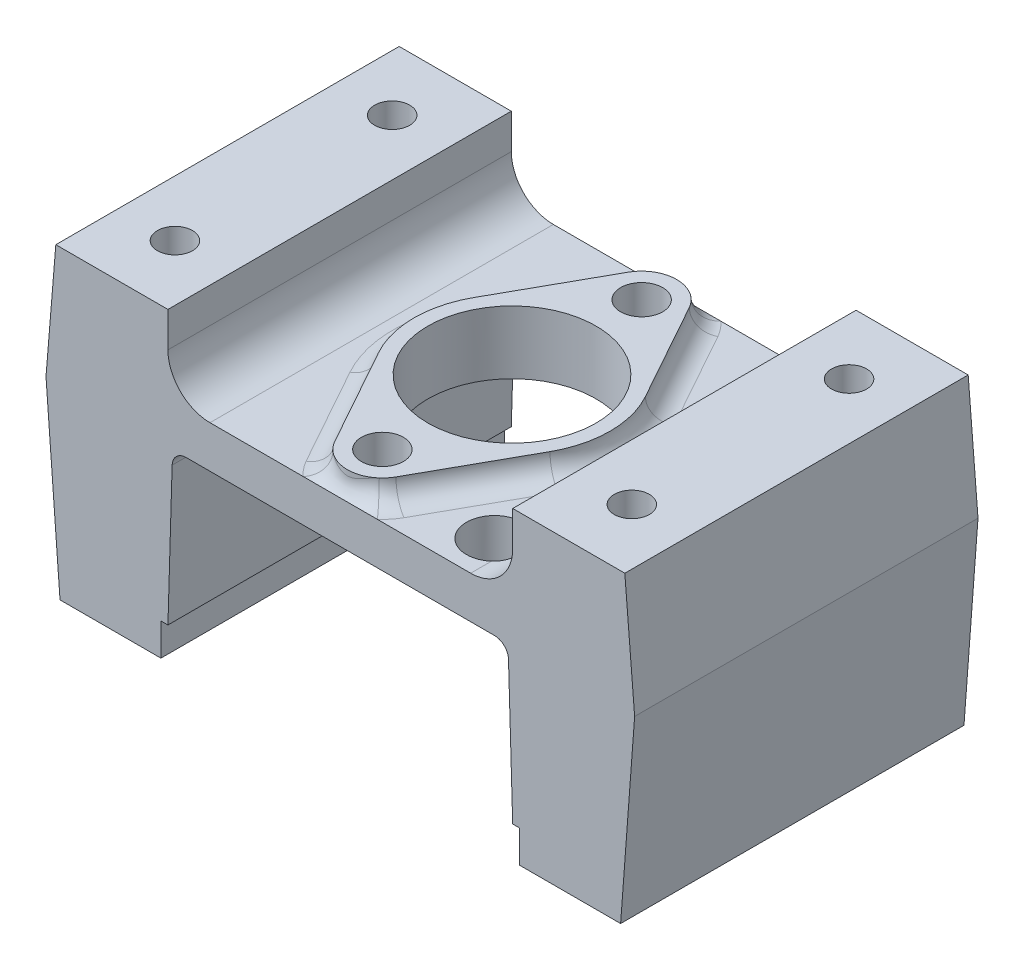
ISO-10303-21;
HEADER;
FILE_DESCRIPTION(('STEP AP214'),'2;1');
FILE_NAME('part.step','',(''),(''),'','','');
FILE_SCHEMA(('AUTOMOTIVE_DESIGN { 1 0 10303 214 1 1 1 1 }'));
ENDSEC;
DATA;
#1=APPLICATION_CONTEXT('core data for automotive mechanical design processes');
#2=APPLICATION_PROTOCOL_DEFINITION('international standard','automotive_design',2000,#1);
#3=PRODUCT_CONTEXT('',#1,'mechanical');
#4=PRODUCT('Part','Part','',(#3));
#5=PRODUCT_RELATED_PRODUCT_CATEGORY('part','',(#4));
#6=PRODUCT_DEFINITION_FORMATION('','',#4);
#7=PRODUCT_DEFINITION_CONTEXT('part definition',#1,'design');
#8=PRODUCT_DEFINITION('design','',#6,#7);
#9=PRODUCT_DEFINITION_SHAPE('','',#8);
#10=(LENGTH_UNIT() NAMED_UNIT(*) SI_UNIT(.MILLI.,.METRE.));
#11=(NAMED_UNIT(*) PLANE_ANGLE_UNIT() SI_UNIT($,.RADIAN.));
#12=(NAMED_UNIT(*) SI_UNIT($,.STERADIAN.) SOLID_ANGLE_UNIT());
#13=UNCERTAINTY_MEASURE_WITH_UNIT(LENGTH_MEASURE(1.E-05),#10,'distance_accuracy_value','');
#14=(GEOMETRIC_REPRESENTATION_CONTEXT(3) GLOBAL_UNCERTAINTY_ASSIGNED_CONTEXT((#13)) GLOBAL_UNIT_ASSIGNED_CONTEXT((#10,
#11,#12)) REPRESENTATION_CONTEXT('',''));
#15=CARTESIAN_POINT('',(0.,0.,0.));
#16=DIRECTION('',(0.,0.,1.));
#17=DIRECTION('',(1.,0.,0.));
#18=AXIS2_PLACEMENT_3D('',#15,#16,#17);
#19=CARTESIAN_POINT('',(-9.3,0.,12.25));
#20=DIRECTION('',(0.,-1.,0.));
#21=DIRECTION('',(0.,0.,-1.));
#22=AXIS2_PLACEMENT_3D('',#19,#20,#21);
#23=PLANE('',#22);
#24=DIRECTION('',(-1.,0.,0.));
#25=VECTOR('',#24,1.);
#26=CARTESIAN_POINT('',(-9.3,0.,-12.25));
#27=LINE('',#26,#25);
#28=CARTESIAN_POINT('',(9.3,0.,-12.25));
#29=VERTEX_POINT('',#28);
#30=CARTESIAN_POINT('',(2.64575131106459,0.,-12.25));
#31=VERTEX_POINT('',#30);
#32=EDGE_CURVE('E678',#29,#31,#27,.T.);
#33=ORIENTED_EDGE('',*,*,#32,.T.);
#34=CARTESIAN_POINT('',(0.,0.,-9.25));
#35=DIRECTION('',(0.,-1.,0.));
#36=DIRECTION('',(0.,0.,-1.));
#37=AXIS2_PLACEMENT_3D('',#34,#35,#36);
#38=CIRCLE('',#37,4.);
#39=CARTESIAN_POINT('',(3.49475240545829,0.,-11.1959459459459));
#40=VERTEX_POINT('',#39);
#41=EDGE_CURVE('E811',#31,#40,#38,.T.);
#42=ORIENTED_EDGE('',*,*,#41,.T.);
#43=DIRECTION('',(-0.486486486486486,0.,-0.873688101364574));
#44=VECTOR('',#43,1.);
#45=CARTESIAN_POINT('',(7.42634886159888,0.,-4.13513513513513));
#46=LINE('',#45,#44);
#47=CARTESIAN_POINT('',(7.42634886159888,0.,-4.13513513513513));
#48=VERTEX_POINT('',#47);
#49=EDGE_CURVE('E1289',#40,#48,#46,.F.);
#50=ORIENTED_EDGE('',*,*,#49,.T.);
#51=CARTESIAN_POINT('',(0.,0.,0.));
#52=DIRECTION('',(0.,-1.,0.));
#53=DIRECTION('',(0.,0.,-1.));
#54=AXIS2_PLACEMENT_3D('',#51,#52,#53);
#55=CIRCLE('',#54,8.5);
#56=CARTESIAN_POINT('',(7.42634886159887,0.,4.13513513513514));
#57=VERTEX_POINT('',#56);
#58=EDGE_CURVE('E1298',#48,#57,#55,.T.);
#59=ORIENTED_EDGE('',*,*,#58,.T.);
#60=DIRECTION('',(0.486486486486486,0.,-0.873688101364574));
#61=VECTOR('',#60,1.);
#62=CARTESIAN_POINT('',(3.49475240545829,0.,11.1959459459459));
#63=LINE('',#62,#61);
#64=CARTESIAN_POINT('',(3.49475240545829,0.,11.1959459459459));
#65=VERTEX_POINT('',#64);
#66=EDGE_CURVE('E1302',#57,#65,#63,.F.);
#67=ORIENTED_EDGE('',*,*,#66,.T.);
#68=CARTESIAN_POINT('',(0.,0.,9.25));
#69=DIRECTION('',(0.,-1.,0.));
#70=DIRECTION('',(0.,0.,-1.));
#71=AXIS2_PLACEMENT_3D('',#68,#69,#70);
#72=CIRCLE('',#71,4.);
#73=CARTESIAN_POINT('',(2.64575131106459,0.,12.25));
#74=VERTEX_POINT('',#73);
#75=EDGE_CURVE('E1307',#65,#74,#72,.T.);
#76=ORIENTED_EDGE('',*,*,#75,.T.);
#77=DIRECTION('',(-1.,0.,0.));
#78=VECTOR('',#77,1.);
#79=CARTESIAN_POINT('',(-9.3,0.,12.25));
#80=LINE('',#79,#78);
#81=CARTESIAN_POINT('',(9.3,0.,12.25));
#82=VERTEX_POINT('',#81);
#83=EDGE_CURVE('E704',#82,#74,#80,.T.);
#84=ORIENTED_EDGE('',*,*,#83,.F.);
#85=DIRECTION('',(0.,0.,-1.));
#86=VECTOR('',#85,1.);
#87=CARTESIAN_POINT('',(9.3,0.,12.25));
#88=LINE('',#87,#86);
#89=CARTESIAN_POINT('',(9.3,0.,10.7698684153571));
#90=VERTEX_POINT('',#89);
#91=EDGE_CURVE('E617',#82,#90,#88,.T.);
#92=ORIENTED_EDGE('',*,*,#91,.T.);
#93=CARTESIAN_POINT('',(8.,0.,9.25));
#94=DIRECTION('',(0.,-1.,0.));
#95=DIRECTION('',(0.,0.,-1.));
#96=AXIS2_PLACEMENT_3D('',#93,#94,#95);
#97=CIRCLE('',#96,2.);
#98=CARTESIAN_POINT('',(9.30000000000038,0.,7.73013158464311));
#99=VERTEX_POINT('',#98);
#100=EDGE_CURVE('E605',#90,#99,#97,.T.);
#101=ORIENTED_EDGE('',*,*,#100,.T.);
#102=EDGE_CURVE('E615',#99,#29,#88,.T.);
#103=ORIENTED_EDGE('',*,*,#102,.T.);
#104=EDGE_LOOP('',(#33,#42,#50,#59,#67,#76,#84,#92,#101,#103));
#105=FACE_BOUND('',#104,.T.);
#106=ADVANCED_FACE('F350',(#105),#23,.F.);
#107=DIRECTION('',(-0.486486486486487,0.,0.873688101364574));
#108=VECTOR('',#107,1.);
#109=CARTESIAN_POINT('',(-3.49475240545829,0.,-11.1959459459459));
#110=LINE('',#109,#108);
#111=CARTESIAN_POINT('',(-7.42634886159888,0.,-4.13513513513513));
#112=VERTEX_POINT('',#111);
#113=CARTESIAN_POINT('',(-3.49475240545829,0.,-11.1959459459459));
#114=VERTEX_POINT('',#113);
#115=EDGE_CURVE('E1311',#112,#114,#110,.F.);
#116=ORIENTED_EDGE('',*,*,#115,.T.);
#117=CARTESIAN_POINT('',(0.,0.,-9.25));
#118=DIRECTION('',(0.,-1.,0.));
#119=DIRECTION('',(0.,0.,-1.));
#120=AXIS2_PLACEMENT_3D('',#117,#118,#119);
#121=CIRCLE('',#120,4.);
#122=CARTESIAN_POINT('',(-2.64575131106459,0.,-12.25));
#123=VERTEX_POINT('',#122);
#124=EDGE_CURVE('E1309',#114,#123,#121,.T.);
#125=ORIENTED_EDGE('',*,*,#124,.T.);
#126=CARTESIAN_POINT('',(-9.3,0.,-12.25));
#127=VERTEX_POINT('',#126);
#128=EDGE_CURVE('E677',#123,#127,#27,.T.);
#129=ORIENTED_EDGE('',*,*,#128,.T.);
#130=DIRECTION('',(0.,0.,-1.));
#131=VECTOR('',#130,1.);
#132=CARTESIAN_POINT('',(-9.3,0.,12.25));
#133=LINE('',#132,#131);
#134=CARTESIAN_POINT('',(-9.3,0.,12.25));
#135=VERTEX_POINT('',#134);
#136=EDGE_CURVE('E611',#135,#127,#133,.T.);
#137=ORIENTED_EDGE('',*,*,#136,.F.);
#138=CARTESIAN_POINT('',(-2.64575131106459,0.,12.25));
#139=VERTEX_POINT('',#138);
#140=EDGE_CURVE('E703',#139,#135,#80,.T.);
#141=ORIENTED_EDGE('',*,*,#140,.F.);
#142=CARTESIAN_POINT('',(0.,0.,9.25));
#143=DIRECTION('',(0.,-1.,0.));
#144=DIRECTION('',(0.,0.,-1.));
#145=AXIS2_PLACEMENT_3D('',#142,#143,#144);
#146=CIRCLE('',#145,4.);
#147=CARTESIAN_POINT('',(-3.49475240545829,0.,11.1959459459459));
#148=VERTEX_POINT('',#147);
#149=EDGE_CURVE('E1314',#139,#148,#146,.T.);
#150=ORIENTED_EDGE('',*,*,#149,.T.);
#151=DIRECTION('',(0.486486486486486,0.,0.873688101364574));
#152=VECTOR('',#151,1.);
#153=CARTESIAN_POINT('',(-7.42634886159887,0.,4.13513513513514));
#154=LINE('',#153,#152);
#155=CARTESIAN_POINT('',(-7.42634886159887,0.,4.13513513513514));
#156=VERTEX_POINT('',#155);
#157=EDGE_CURVE('E610',#148,#156,#154,.F.);
#158=ORIENTED_EDGE('',*,*,#157,.T.);
#159=CARTESIAN_POINT('',(0.,0.,0.));
#160=DIRECTION('',(0.,-1.,0.));
#161=DIRECTION('',(0.,0.,-1.));
#162=AXIS2_PLACEMENT_3D('',#159,#160,#161);
#163=CIRCLE('',#162,8.5);
#164=EDGE_CURVE('E1313',#156,#112,#163,.T.);
#165=ORIENTED_EDGE('',*,*,#164,.T.);
#166=EDGE_LOOP('',(#116,#125,#129,#137,#141,#150,#158,#165));
#167=FACE_BOUND('',#166,.T.);
#168=ADVANCED_FACE('F815',(#167),#23,.F.);
#169=CARTESIAN_POINT('',(-9.3,3.,12.25));
#170=DIRECTION('',(0.,0.,-1.));
#171=DIRECTION('',(-1.,0.,0.));
#172=AXIS2_PLACEMENT_3D('',#169,#170,#171);
#173=CYLINDRICAL_SURFACE('',#172,3.);
#174=CARTESIAN_POINT('',(-9.3,3.,-12.25));
#175=DIRECTION('',(0.,0.,-1.));
#176=DIRECTION('',(-1.,0.,0.));
#177=AXIS2_PLACEMENT_3D('',#174,#175,#176);
#178=CIRCLE('',#177,3.);
#179=CARTESIAN_POINT('',(-12.3,3.,-12.25));
#180=VERTEX_POINT('',#179);
#181=EDGE_CURVE('E680',#127,#180,#178,.T.);
#182=ORIENTED_EDGE('',*,*,#181,.T.);
#183=DIRECTION('',(0.,0.,-1.));
#184=VECTOR('',#183,1.);
#185=CARTESIAN_POINT('',(-12.3,3.,12.25));
#186=LINE('',#185,#184);
#187=CARTESIAN_POINT('',(-12.3,3.,12.25));
#188=VERTEX_POINT('',#187);
#189=EDGE_CURVE('E757',#188,#180,#186,.T.);
#190=ORIENTED_EDGE('',*,*,#189,.F.);
#191=CARTESIAN_POINT('',(-9.3,3.,12.25));
#192=DIRECTION('',(0.,0.,-1.));
#193=DIRECTION('',(-1.,0.,0.));
#194=AXIS2_PLACEMENT_3D('',#191,#192,#193);
#195=CIRCLE('',#194,3.);
#196=EDGE_CURVE('E707',#135,#188,#195,.T.);
#197=ORIENTED_EDGE('',*,*,#196,.F.);
#198=ORIENTED_EDGE('',*,*,#136,.T.);
#199=EDGE_LOOP('',(#182,#190,#197,#198));
#200=FACE_BOUND('',#199,.T.);
#201=ADVANCED_FACE('F819',(#200),#173,.F.);
#202=CARTESIAN_POINT('',(-12.3,5.5,12.25));
#203=DIRECTION('',(-1.,0.,0.));
#204=DIRECTION('',(0.,-1.,0.));
#205=AXIS2_PLACEMENT_3D('',#202,#203,#204);
#206=PLANE('',#205);
#207=DIRECTION('',(0.,1.,0.));
#208=VECTOR('',#207,1.);
#209=CARTESIAN_POINT('',(-12.3,5.5,-12.25));
#210=LINE('',#209,#208);
#211=CARTESIAN_POINT('',(-12.3,5.5,-12.25));
#212=VERTEX_POINT('',#211);
#213=EDGE_CURVE('E683',#180,#212,#210,.T.);
#214=ORIENTED_EDGE('',*,*,#213,.T.);
#215=DIRECTION('',(0.,0.,-1.));
#216=VECTOR('',#215,1.);
#217=CARTESIAN_POINT('',(-12.3,5.5,12.25));
#218=LINE('',#217,#216);
#219=CARTESIAN_POINT('',(-12.3,5.5,12.25));
#220=VERTEX_POINT('',#219);
#221=EDGE_CURVE('E754',#220,#212,#218,.T.);
#222=ORIENTED_EDGE('',*,*,#221,.F.);
#223=DIRECTION('',(0.,1.,0.));
#224=VECTOR('',#223,1.);
#225=CARTESIAN_POINT('',(-12.3,5.5,12.25));
#226=LINE('',#225,#224);
#227=EDGE_CURVE('E710',#188,#220,#226,.T.);
#228=ORIENTED_EDGE('',*,*,#227,.F.);
#229=ORIENTED_EDGE('',*,*,#189,.T.);
#230=EDGE_LOOP('',(#214,#222,#228,#229));
#231=FACE_BOUND('',#230,.T.);
#232=ADVANCED_FACE('F882',(#231),#206,.F.);
#233=CARTESIAN_POINT('',(-20.3,5.5,12.25));
#234=DIRECTION('',(0.,-1.,0.));
#235=DIRECTION('',(0.,0.,-1.));
#236=AXIS2_PLACEMENT_3D('',#233,#234,#235);
#237=PLANE('',#236);
#238=CARTESIAN_POINT('',(-16.3,5.5,-7.75));
#239=DIRECTION('',(0.,1.,0.));
#240=DIRECTION('',(0.,0.,1.));
#241=AXIS2_PLACEMENT_3D('',#238,#239,#240);
#242=CIRCLE('',#241,1.25);
#243=CARTESIAN_POINT('',(-16.3,5.5,-6.5));
#244=VERTEX_POINT('',#243);
#245=EDGE_CURVE('E668',#244,#244,#242,.T.);
#246=ORIENTED_EDGE('',*,*,#245,.F.);
#247=EDGE_LOOP('',(#246));
#248=FACE_BOUND('',#247,.T.);
#249=CARTESIAN_POINT('',(-16.3,5.5,7.75));
#250=DIRECTION('',(0.,1.,0.));
#251=DIRECTION('',(0.,0.,1.));
#252=AXIS2_PLACEMENT_3D('',#249,#250,#251);
#253=CIRCLE('',#252,1.25);
#254=CARTESIAN_POINT('',(-16.3,5.5,9.));
#255=VERTEX_POINT('',#254);
#256=EDGE_CURVE('E674',#255,#255,#253,.T.);
#257=ORIENTED_EDGE('',*,*,#256,.F.);
#258=EDGE_LOOP('',(#257));
#259=FACE_BOUND('',#258,.T.);
#260=DIRECTION('',(-1.,0.,0.));
#261=VECTOR('',#260,1.);
#262=CARTESIAN_POINT('',(-20.3,5.5,-12.25));
#263=LINE('',#262,#261);
#264=CARTESIAN_POINT('',(-20.3,5.5,-12.25));
#265=VERTEX_POINT('',#264);
#266=EDGE_CURVE('E685',#212,#265,#263,.T.);
#267=ORIENTED_EDGE('',*,*,#266,.T.);
#268=DIRECTION('',(0.,0.,-1.));
#269=VECTOR('',#268,1.);
#270=CARTESIAN_POINT('',(-20.3,5.5,12.25));
#271=LINE('',#270,#269);
#272=CARTESIAN_POINT('',(-20.3,5.5,12.25));
#273=VERTEX_POINT('',#272);
#274=EDGE_CURVE('E751',#273,#265,#271,.T.);
#275=ORIENTED_EDGE('',*,*,#274,.F.);
#276=DIRECTION('',(-1.,0.,0.));
#277=VECTOR('',#276,1.);
#278=CARTESIAN_POINT('',(-20.3,5.5,12.25));
#279=LINE('',#278,#277);
#280=EDGE_CURVE('E712',#220,#273,#279,.T.);
#281=ORIENTED_EDGE('',*,*,#280,.F.);
#282=ORIENTED_EDGE('',*,*,#221,.T.);
#283=EDGE_LOOP('',(#267,#275,#281,#282));
#284=FACE_BOUND('',#283,.T.);
#285=ADVANCED_FACE('F889',(#248,#259,#284),#237,.F.);
#286=CARTESIAN_POINT('',(-21.,-3.,12.25));
#287=DIRECTION('',(0.996626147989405,-0.0820750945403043,0.));
#288=DIRECTION('',(0.0820750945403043,0.996626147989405,0.));
#289=AXIS2_PLACEMENT_3D('',#286,#287,#288);
#290=PLANE('',#289);
#291=DIRECTION('',(-0.0820750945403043,-0.996626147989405,0.));
#292=VECTOR('',#291,1.);
#293=CARTESIAN_POINT('',(-21.,-3.,-12.25));
#294=LINE('',#293,#292);
#295=CARTESIAN_POINT('',(-21.,-3.,-12.25));
#296=VERTEX_POINT('',#295);
#297=EDGE_CURVE('E687',#265,#296,#294,.T.);
#298=ORIENTED_EDGE('',*,*,#297,.T.);
#299=DIRECTION('',(0.,0.,-1.));
#300=VECTOR('',#299,1.);
#301=CARTESIAN_POINT('',(-21.,-3.,12.25));
#302=LINE('',#301,#300);
#303=CARTESIAN_POINT('',(-21.,-3.,12.25));
#304=VERTEX_POINT('',#303);
#305=EDGE_CURVE('E748',#304,#296,#302,.T.);
#306=ORIENTED_EDGE('',*,*,#305,.F.);
#307=DIRECTION('',(-0.0820750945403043,-0.996626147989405,0.));
#308=VECTOR('',#307,1.);
#309=CARTESIAN_POINT('',(-21.,-3.,12.25));
#310=LINE('',#309,#308);
#311=EDGE_CURVE('E714',#273,#304,#310,.T.);
#312=ORIENTED_EDGE('',*,*,#311,.F.);
#313=ORIENTED_EDGE('',*,*,#274,.T.);
#314=EDGE_LOOP('',(#298,#306,#312,#313));
#315=FACE_BOUND('',#314,.T.);
#316=ADVANCED_FACE('F896',(#315),#290,.F.);
#317=CARTESIAN_POINT('',(-20.,-16.3,12.25));
#318=DIRECTION('',(0.997185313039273,0.0749763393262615,0.));
#319=DIRECTION('',(-0.0749763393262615,0.997185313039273,0.));
#320=AXIS2_PLACEMENT_3D('',#317,#318,#319);
#321=PLANE('',#320);
#322=DIRECTION('',(0.0749763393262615,-0.997185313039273,0.));
#323=VECTOR('',#322,1.);
#324=CARTESIAN_POINT('',(-20.,-16.3,-12.25));
#325=LINE('',#324,#323);
#326=CARTESIAN_POINT('',(-20.,-16.3,-12.25));
#327=VERTEX_POINT('',#326);
#328=EDGE_CURVE('E689',#296,#327,#325,.T.);
#329=ORIENTED_EDGE('',*,*,#328,.T.);
#330=DIRECTION('',(0.,0.,-1.));
#331=VECTOR('',#330,1.);
#332=CARTESIAN_POINT('',(-20.,-16.3,12.25));
#333=LINE('',#332,#331);
#334=CARTESIAN_POINT('',(-20.,-16.3,12.25));
#335=VERTEX_POINT('',#334);
#336=EDGE_CURVE('E745',#335,#327,#333,.T.);
#337=ORIENTED_EDGE('',*,*,#336,.F.);
#338=DIRECTION('',(0.0749763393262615,-0.997185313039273,0.));
#339=VECTOR('',#338,1.);
#340=CARTESIAN_POINT('',(-20.,-16.3,12.25));
#341=LINE('',#340,#339);
#342=EDGE_CURVE('E716',#304,#335,#341,.T.);
#343=ORIENTED_EDGE('',*,*,#342,.F.);
#344=ORIENTED_EDGE('',*,*,#305,.T.);
#345=EDGE_LOOP('',(#329,#337,#343,#344));
#346=FACE_BOUND('',#345,.T.);
#347=ADVANCED_FACE('F904',(#346),#321,.F.);
#348=CARTESIAN_POINT('',(-12.8,-16.3,12.25));
#349=DIRECTION('',(0.,1.,0.));
#350=DIRECTION('',(0.,0.,1.));
#351=AXIS2_PLACEMENT_3D('',#348,#349,#350);
#352=PLANE('',#351);
#353=CARTESIAN_POINT('',(-16.25,-16.3,7.25));
#354=DIRECTION('',(0.,-1.,0.));
#355=DIRECTION('',(0.,0.,-1.));
#356=AXIS2_PLACEMENT_3D('',#353,#354,#355);
#357=CIRCLE('',#356,1.24999999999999);
#358=CARTESIAN_POINT('',(-16.25,-16.3,6.00000000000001));
#359=VERTEX_POINT('',#358);
#360=EDGE_CURVE('E656',#359,#359,#357,.T.);
#361=ORIENTED_EDGE('',*,*,#360,.F.);
#362=EDGE_LOOP('',(#361));
#363=FACE_BOUND('',#362,.T.);
#364=CARTESIAN_POINT('',(-16.25,-16.3,-4.25));
#365=DIRECTION('',(0.,-1.,0.));
#366=DIRECTION('',(0.,0.,-1.));
#367=AXIS2_PLACEMENT_3D('',#364,#365,#366);
#368=CIRCLE('',#367,1.24999999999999);
#369=CARTESIAN_POINT('',(-16.25,-16.3,-5.49999999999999));
#370=VERTEX_POINT('',#369);
#371=EDGE_CURVE('E662',#370,#370,#368,.T.);
#372=ORIENTED_EDGE('',*,*,#371,.F.);
#373=EDGE_LOOP('',(#372));
#374=FACE_BOUND('',#373,.T.);
#375=DIRECTION('',(1.,0.,0.));
#376=VECTOR('',#375,1.);
#377=CARTESIAN_POINT('',(-12.8,-16.3,-12.25));
#378=LINE('',#377,#376);
#379=CARTESIAN_POINT('',(-12.8,-16.3,-12.25));
#380=VERTEX_POINT('',#379);
#381=EDGE_CURVE('E691',#327,#380,#378,.T.);
#382=ORIENTED_EDGE('',*,*,#381,.T.);
#383=DIRECTION('',(0.,0.,-1.));
#384=VECTOR('',#383,1.);
#385=CARTESIAN_POINT('',(-12.8,-16.3,12.25));
#386=LINE('',#385,#384);
#387=CARTESIAN_POINT('',(-12.8,-16.3,12.25));
#388=VERTEX_POINT('',#387);
#389=EDGE_CURVE('E742',#388,#380,#386,.T.);
#390=ORIENTED_EDGE('',*,*,#389,.F.);
#391=DIRECTION('',(1.,0.,0.));
#392=VECTOR('',#391,1.);
#393=CARTESIAN_POINT('',(-12.8,-16.3,12.25));
#394=LINE('',#393,#392);
#395=EDGE_CURVE('E718',#335,#388,#394,.T.);
#396=ORIENTED_EDGE('',*,*,#395,.F.);
#397=ORIENTED_EDGE('',*,*,#336,.T.);
#398=EDGE_LOOP('',(#382,#390,#396,#397));
#399=FACE_BOUND('',#398,.T.);
#400=ADVANCED_FACE('F912',(#363,#374,#399),#352,.F.);
#401=CARTESIAN_POINT('',(-12.8,-14.,12.25));
#402=DIRECTION('',(-1.,0.,0.));
#403=DIRECTION('',(0.,-1.,0.));
#404=AXIS2_PLACEMENT_3D('',#401,#402,#403);
#405=PLANE('',#404);
#406=DIRECTION('',(0.,1.,0.));
#407=VECTOR('',#406,1.);
#408=CARTESIAN_POINT('',(-12.8,-14.,-12.25));
#409=LINE('',#408,#407);
#410=CARTESIAN_POINT('',(-12.8,-14.,-12.25));
#411=VERTEX_POINT('',#410);
#412=EDGE_CURVE('E693',#380,#411,#409,.T.);
#413=ORIENTED_EDGE('',*,*,#412,.T.);
#414=DIRECTION('',(0.,0.,-1.));
#415=VECTOR('',#414,1.);
#416=CARTESIAN_POINT('',(-12.8,-14.,12.25));
#417=LINE('',#416,#415);
#418=CARTESIAN_POINT('',(-12.8,-14.,12.25));
#419=VERTEX_POINT('',#418);
#420=EDGE_CURVE('E739',#419,#411,#417,.T.);
#421=ORIENTED_EDGE('',*,*,#420,.F.);
#422=DIRECTION('',(0.,1.,0.));
#423=VECTOR('',#422,1.);
#424=CARTESIAN_POINT('',(-12.8,-14.,12.25));
#425=LINE('',#424,#423);
#426=EDGE_CURVE('E720',#388,#419,#425,.T.);
#427=ORIENTED_EDGE('',*,*,#426,.F.);
#428=ORIENTED_EDGE('',*,*,#389,.T.);
#429=EDGE_LOOP('',(#413,#421,#427,#428));
#430=FACE_BOUND('',#429,.T.);
#431=ADVANCED_FACE('F920',(#430),#405,.F.);
#432=CARTESIAN_POINT('',(-12.8,-14.,12.25));
#433=DIRECTION('',(0.,1.,0.));
#434=DIRECTION('',(0.,0.,1.));
#435=AXIS2_PLACEMENT_3D('',#432,#433,#434);
#436=PLANE('',#435);
#437=DIRECTION('',(1.,0.,0.));
#438=VECTOR('',#437,1.);
#439=CARTESIAN_POINT('',(-12.8,-14.,-12.25));
#440=LINE('',#439,#438);
#441=CARTESIAN_POINT('',(-12.3,-14.,-12.25));
#442=VERTEX_POINT('',#441);
#443=EDGE_CURVE('E695',#411,#442,#440,.T.);
#444=ORIENTED_EDGE('',*,*,#443,.T.);
#445=DIRECTION('',(0.,0.,-1.));
#446=VECTOR('',#445,1.);
#447=CARTESIAN_POINT('',(-12.3,-14.,12.25));
#448=LINE('',#447,#446);
#449=CARTESIAN_POINT('',(-12.3,-14.,12.25));
#450=VERTEX_POINT('',#449);
#451=EDGE_CURVE('E736',#450,#442,#448,.T.);
#452=ORIENTED_EDGE('',*,*,#451,.F.);
#453=DIRECTION('',(1.,0.,0.));
#454=VECTOR('',#453,1.);
#455=CARTESIAN_POINT('',(-12.8,-14.,12.25));
#456=LINE('',#455,#454);
#457=EDGE_CURVE('E722',#419,#450,#456,.T.);
#458=ORIENTED_EDGE('',*,*,#457,.F.);
#459=ORIENTED_EDGE('',*,*,#420,.T.);
#460=EDGE_LOOP('',(#444,#452,#458,#459));
#461=FACE_BOUND('',#460,.T.);
#462=ADVANCED_FACE('F928',(#461),#436,.F.);
#463=CARTESIAN_POINT('',(-11.99955164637,-3.9700582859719,12.25));
#464=DIRECTION('',(-0.999551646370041,0.0299417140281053,0.));
#465=DIRECTION('',(-0.0299417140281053,-0.999551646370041,0.));
#466=AXIS2_PLACEMENT_3D('',#463,#464,#465);
#467=PLANE('',#466);
#468=DIRECTION('',(0.0299417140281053,0.999551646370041,0.));
#469=VECTOR('',#468,1.);
#470=CARTESIAN_POINT('',(-11.99955164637,-3.9700582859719,-12.25));
#471=LINE('',#470,#469);
#472=CARTESIAN_POINT('',(-11.99955164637,-3.9700582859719,-12.25));
#473=VERTEX_POINT('',#472);
#474=EDGE_CURVE('E697',#442,#473,#471,.T.);
#475=ORIENTED_EDGE('',*,*,#474,.T.);
#476=DIRECTION('',(0.,0.,-1.));
#477=VECTOR('',#476,1.);
#478=CARTESIAN_POINT('',(-11.99955164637,-3.9700582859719,12.25));
#479=LINE('',#478,#477);
#480=CARTESIAN_POINT('',(-11.99955164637,-3.9700582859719,12.25));
#481=VERTEX_POINT('',#480);
#482=EDGE_CURVE('E733',#481,#473,#479,.T.);
#483=ORIENTED_EDGE('',*,*,#482,.F.);
#484=DIRECTION('',(0.0299417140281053,0.999551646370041,0.));
#485=VECTOR('',#484,1.);
#486=CARTESIAN_POINT('',(-11.99955164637,-3.9700582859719,12.25));
#487=LINE('',#486,#485);
#488=EDGE_CURVE('E724',#450,#481,#487,.T.);
#489=ORIENTED_EDGE('',*,*,#488,.F.);
#490=ORIENTED_EDGE('',*,*,#451,.T.);
#491=EDGE_LOOP('',(#475,#483,#489,#490));
#492=FACE_BOUND('',#491,.T.);
#493=ADVANCED_FACE('F936',(#492),#467,.F.);
#494=CARTESIAN_POINT('',(-11.,-4.,12.25));
#495=DIRECTION('',(0.,0.,-1.));
#496=DIRECTION('',(-1.,0.,0.));
#497=AXIS2_PLACEMENT_3D('',#494,#495,#496);
#498=CYLINDRICAL_SURFACE('',#497,0.999999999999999);
#499=CARTESIAN_POINT('',(-11.,-4.,-12.25));
#500=DIRECTION('',(0.,0.,-1.));
#501=DIRECTION('',(-1.,0.,0.));
#502=AXIS2_PLACEMENT_3D('',#499,#500,#501);
#503=CIRCLE('',#502,0.999999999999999);
#504=CARTESIAN_POINT('',(-11.,-3.,-12.25));
#505=VERTEX_POINT('',#504);
#506=EDGE_CURVE('E699',#473,#505,#503,.T.);
#507=ORIENTED_EDGE('',*,*,#506,.T.);
#508=DIRECTION('',(0.,0.,-1.));
#509=VECTOR('',#508,1.);
#510=CARTESIAN_POINT('',(-11.,-3.,12.25));
#511=LINE('',#510,#509);
#512=CARTESIAN_POINT('',(-11.,-3.,12.25));
#513=VERTEX_POINT('',#512);
#514=EDGE_CURVE('E730',#513,#505,#511,.T.);
#515=ORIENTED_EDGE('',*,*,#514,.F.);
#516=CARTESIAN_POINT('',(-11.,-4.,12.25));
#517=DIRECTION('',(0.,0.,-1.));
#518=DIRECTION('',(-1.,0.,0.));
#519=AXIS2_PLACEMENT_3D('',#516,#517,#518);
#520=CIRCLE('',#519,0.999999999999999);
#521=EDGE_CURVE('E726',#481,#513,#520,.T.);
#522=ORIENTED_EDGE('',*,*,#521,.F.);
#523=ORIENTED_EDGE('',*,*,#482,.T.);
#524=EDGE_LOOP('',(#507,#515,#522,#523));
#525=FACE_BOUND('',#524,.T.);
#526=ADVANCED_FACE('F944',(#525),#498,.F.);
#527=CARTESIAN_POINT('',(0.,-3.,12.25));
#528=DIRECTION('',(0.,1.,0.));
#529=DIRECTION('',(-1.,0.,0.));
#530=AXIS2_PLACEMENT_3D('',#527,#528,#529);
#531=PLANE('',#530);
#532=CARTESIAN_POINT('',(8.,-3.,9.25));
#533=DIRECTION('',(0.,1.,0.));
#534=DIRECTION('',(-1.,0.,0.));
#535=AXIS2_PLACEMENT_3D('',#532,#533,#534);
#536=CIRCLE('',#535,2.);
#537=CARTESIAN_POINT('',(6.,-3.,9.25));
#538=VERTEX_POINT('',#537);
#539=EDGE_CURVE('E618',#538,#538,#536,.T.);
#540=ORIENTED_EDGE('',*,*,#539,.T.);
#541=EDGE_LOOP('',(#540));
#542=FACE_BOUND('',#541,.T.);
#543=CARTESIAN_POINT('',(0.,-3.,9.25));
#544=DIRECTION('',(0.,1.,0.));
#545=DIRECTION('',(-1.,0.,0.));
#546=AXIS2_PLACEMENT_3D('',#543,#544,#545);
#547=CIRCLE('',#546,1.5);
#548=CARTESIAN_POINT('',(-1.5,-3.,9.25));
#549=VERTEX_POINT('',#548);
#550=EDGE_CURVE('E1526',#549,#549,#547,.T.);
#551=ORIENTED_EDGE('',*,*,#550,.T.);
#552=EDGE_LOOP('',(#551));
#553=FACE_BOUND('',#552,.T.);
#554=CARTESIAN_POINT('',(0.,-3.,-9.25));
#555=DIRECTION('',(0.,1.,0.));
#556=DIRECTION('',(-1.,0.,0.));
#557=AXIS2_PLACEMENT_3D('',#554,#555,#556);
#558=CIRCLE('',#557,1.5);
#559=CARTESIAN_POINT('',(-1.5,-3.,-9.25));
#560=VERTEX_POINT('',#559);
#561=EDGE_CURVE('E1520',#560,#560,#558,.T.);
#562=ORIENTED_EDGE('',*,*,#561,.T.);
#563=EDGE_LOOP('',(#562));
#564=FACE_BOUND('',#563,.T.);
#565=CARTESIAN_POINT('',(0.,-3.,0.));
#566=DIRECTION('',(0.,1.,0.));
#567=DIRECTION('',(-1.,0.,0.));
#568=AXIS2_PLACEMENT_3D('',#565,#566,#567);
#569=CIRCLE('',#568,6.);
#570=CARTESIAN_POINT('',(-6.,-3.,0.));
#571=VERTEX_POINT('',#570);
#572=EDGE_CURVE('E1514',#571,#571,#569,.T.);
#573=ORIENTED_EDGE('',*,*,#572,.T.);
#574=EDGE_LOOP('',(#573));
#575=FACE_BOUND('',#574,.T.);
#576=DIRECTION('',(1.,0.,0.));
#577=VECTOR('',#576,1.);
#578=CARTESIAN_POINT('',(0.,-3.,-12.25));
#579=LINE('',#578,#577);
#580=CARTESIAN_POINT('',(11.,-3.,-12.25));
#581=VERTEX_POINT('',#580);
#582=EDGE_CURVE('E701',#505,#581,#579,.T.);
#583=ORIENTED_EDGE('',*,*,#582,.T.);
#584=DIRECTION('',(0.,0.,-1.));
#585=VECTOR('',#584,1.);
#586=CARTESIAN_POINT('',(11.,-3.,12.25));
#587=LINE('',#586,#585);
#588=CARTESIAN_POINT('',(11.,-3.,12.25));
#589=VERTEX_POINT('',#588);
#590=EDGE_CURVE('E650',#589,#581,#587,.T.);
#591=ORIENTED_EDGE('',*,*,#590,.F.);
#592=DIRECTION('',(1.,0.,0.));
#593=VECTOR('',#592,1.);
#594=CARTESIAN_POINT('',(0.,-3.,12.25));
#595=LINE('',#594,#593);
#596=EDGE_CURVE('E728',#513,#589,#595,.T.);
#597=ORIENTED_EDGE('',*,*,#596,.F.);
#598=ORIENTED_EDGE('',*,*,#514,.T.);
#599=EDGE_LOOP('',(#583,#591,#597,#598));
#600=FACE_BOUND('',#599,.T.);
#601=ADVANCED_FACE('F952',(#542,#553,#564,#575,#600),#531,.F.);
#602=CARTESIAN_POINT('',(-11.,-4.,12.25));
#603=DIRECTION('',(0.,0.,-1.));
#604=DIRECTION('',(-1.,0.,0.));
#605=AXIS2_PLACEMENT_3D('',#602,#603,#604);
#606=PLANE('',#605);
#607=ORIENTED_EDGE('',*,*,#83,.T.);
#608=EDGE_CURVE('E708',#74,#139,#80,.T.);
#609=ORIENTED_EDGE('',*,*,#608,.T.);
#610=ORIENTED_EDGE('',*,*,#140,.T.);
#611=ORIENTED_EDGE('',*,*,#196,.T.);
#612=ORIENTED_EDGE('',*,*,#227,.T.);
#613=ORIENTED_EDGE('',*,*,#280,.T.);
#614=ORIENTED_EDGE('',*,*,#311,.T.);
#615=ORIENTED_EDGE('',*,*,#342,.T.);
#616=ORIENTED_EDGE('',*,*,#395,.T.);
#617=ORIENTED_EDGE('',*,*,#426,.T.);
#618=ORIENTED_EDGE('',*,*,#457,.T.);
#619=ORIENTED_EDGE('',*,*,#488,.T.);
#620=ORIENTED_EDGE('',*,*,#521,.T.);
#621=ORIENTED_EDGE('',*,*,#596,.T.);
#622=CARTESIAN_POINT('',(11.,-4.,12.25));
#623=DIRECTION('',(0.,0.,1.));
#624=DIRECTION('',(1.,0.,0.));
#625=AXIS2_PLACEMENT_3D('',#622,#623,#624);
#626=CIRCLE('',#625,0.999999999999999);
#627=CARTESIAN_POINT('',(11.99955164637,-3.97005828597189,12.25));
#628=VERTEX_POINT('',#627);
#629=EDGE_CURVE('E1415',#628,#589,#626,.T.);
#630=ORIENTED_EDGE('',*,*,#629,.F.);
#631=DIRECTION('',(-0.0299417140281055,0.999551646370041,0.));
#632=VECTOR('',#631,1.);
#633=CARTESIAN_POINT('',(11.99955164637,-3.97005828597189,12.25));
#634=LINE('',#633,#632);
#635=CARTESIAN_POINT('',(12.3,-14.,12.25));
#636=VERTEX_POINT('',#635);
#637=EDGE_CURVE('E1418',#636,#628,#634,.T.);
#638=ORIENTED_EDGE('',*,*,#637,.F.);
#639=DIRECTION('',(-1.,0.,0.));
#640=VECTOR('',#639,1.);
#641=CARTESIAN_POINT('',(12.8,-14.,12.25));
#642=LINE('',#641,#640);
#643=CARTESIAN_POINT('',(12.8,-14.,12.25));
#644=VERTEX_POINT('',#643);
#645=EDGE_CURVE('E1423',#644,#636,#642,.T.);
#646=ORIENTED_EDGE('',*,*,#645,.F.);
#647=DIRECTION('',(0.,1.,0.));
#648=VECTOR('',#647,1.);
#649=CARTESIAN_POINT('',(12.8,-14.,12.25));
#650=LINE('',#649,#648);
#651=CARTESIAN_POINT('',(12.8,-16.3,12.25));
#652=VERTEX_POINT('',#651);
#653=EDGE_CURVE('E1425',#652,#644,#650,.T.);
#654=ORIENTED_EDGE('',*,*,#653,.F.);
#655=DIRECTION('',(-1.,0.,0.));
#656=VECTOR('',#655,1.);
#657=CARTESIAN_POINT('',(12.8,-16.3,12.25));
#658=LINE('',#657,#656);
#659=CARTESIAN_POINT('',(20.,-16.3,12.25));
#660=VERTEX_POINT('',#659);
#661=EDGE_CURVE('E1431',#660,#652,#658,.T.);
#662=ORIENTED_EDGE('',*,*,#661,.F.);
#663=DIRECTION('',(-0.0749763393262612,-0.997185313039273,0.));
#664=VECTOR('',#663,1.);
#665=CARTESIAN_POINT('',(20.,-16.3,12.25));
#666=LINE('',#665,#664);
#667=CARTESIAN_POINT('',(21.,-3.,12.25));
#668=VERTEX_POINT('',#667);
#669=EDGE_CURVE('E1434',#668,#660,#666,.T.);
#670=ORIENTED_EDGE('',*,*,#669,.F.);
#671=DIRECTION('',(0.0820750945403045,-0.996626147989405,0.));
#672=VECTOR('',#671,1.);
#673=CARTESIAN_POINT('',(21.,-3.,12.25));
#674=LINE('',#673,#672);
#675=CARTESIAN_POINT('',(20.3,5.5,12.25));
#676=VERTEX_POINT('',#675);
#677=EDGE_CURVE('E1437',#676,#668,#674,.T.);
#678=ORIENTED_EDGE('',*,*,#677,.F.);
#679=DIRECTION('',(1.,0.,0.));
#680=VECTOR('',#679,1.);
#681=CARTESIAN_POINT('',(20.3,5.5,12.25));
#682=LINE('',#681,#680);
#683=CARTESIAN_POINT('',(12.3,5.5,12.25));
#684=VERTEX_POINT('',#683);
#685=EDGE_CURVE('E1440',#684,#676,#682,.T.);
#686=ORIENTED_EDGE('',*,*,#685,.F.);
#687=DIRECTION('',(0.,1.,0.));
#688=VECTOR('',#687,1.);
#689=CARTESIAN_POINT('',(12.3,5.5,12.25));
#690=LINE('',#689,#688);
#691=CARTESIAN_POINT('',(12.3,3.,12.25));
#692=VERTEX_POINT('',#691);
#693=EDGE_CURVE('E629',#692,#684,#690,.T.);
#694=ORIENTED_EDGE('',*,*,#693,.F.);
#695=CARTESIAN_POINT('',(9.3,3.,12.25));
#696=DIRECTION('',(0.,0.,1.));
#697=DIRECTION('',(1.,0.,0.));
#698=AXIS2_PLACEMENT_3D('',#695,#696,#697);
#699=CIRCLE('',#698,3.);
#700=EDGE_CURVE('E625',#82,#692,#699,.T.);
#701=ORIENTED_EDGE('',*,*,#700,.F.);
#702=EDGE_LOOP('',(#607,#609,#610,#611,#612,#613,#614,#615,#616,#617,#618,#619,#620,#621,#630,
#638,#646,#654,#662,#670,#678,#686,#694,#701));
#703=FACE_BOUND('',#702,.T.);
#704=ADVANCED_FACE('F838',(#703),#606,.F.);
#705=CARTESIAN_POINT('',(-11.,-4.,-12.25));
#706=DIRECTION('',(0.,0.,-1.));
#707=DIRECTION('',(-1.,0.,0.));
#708=AXIS2_PLACEMENT_3D('',#705,#706,#707);
#709=PLANE('',#708);
#710=ORIENTED_EDGE('',*,*,#32,.F.);
#711=CARTESIAN_POINT('',(9.3,3.,-12.25));
#712=DIRECTION('',(0.,0.,1.));
#713=DIRECTION('',(1.,0.,0.));
#714=AXIS2_PLACEMENT_3D('',#711,#712,#713);
#715=CIRCLE('',#714,3.);
#716=CARTESIAN_POINT('',(12.3,3.,-12.25));
#717=VERTEX_POINT('',#716);
#718=EDGE_CURVE('E624',#29,#717,#715,.T.);
#719=ORIENTED_EDGE('',*,*,#718,.T.);
#720=DIRECTION('',(0.,1.,0.));
#721=VECTOR('',#720,1.);
#722=CARTESIAN_POINT('',(12.3,5.5,-12.25));
#723=LINE('',#722,#721);
#724=CARTESIAN_POINT('',(12.3,5.5,-12.25));
#725=VERTEX_POINT('',#724);
#726=EDGE_CURVE('E1450',#717,#725,#723,.T.);
#727=ORIENTED_EDGE('',*,*,#726,.T.);
#728=DIRECTION('',(1.,0.,0.));
#729=VECTOR('',#728,1.);
#730=CARTESIAN_POINT('',(20.3,5.5,-12.25));
#731=LINE('',#730,#729);
#732=CARTESIAN_POINT('',(20.3,5.5,-12.25));
#733=VERTEX_POINT('',#732);
#734=EDGE_CURVE('E1452',#725,#733,#731,.T.);
#735=ORIENTED_EDGE('',*,*,#734,.T.);
#736=DIRECTION('',(0.0820750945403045,-0.996626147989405,0.));
#737=VECTOR('',#736,1.);
#738=CARTESIAN_POINT('',(21.,-3.,-12.25));
#739=LINE('',#738,#737);
#740=CARTESIAN_POINT('',(21.,-3.,-12.25));
#741=VERTEX_POINT('',#740);
#742=EDGE_CURVE('E1456',#733,#741,#739,.T.);
#743=ORIENTED_EDGE('',*,*,#742,.T.);
#744=DIRECTION('',(-0.0749763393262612,-0.997185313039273,0.));
#745=VECTOR('',#744,1.);
#746=CARTESIAN_POINT('',(20.,-16.3,-12.25));
#747=LINE('',#746,#745);
#748=CARTESIAN_POINT('',(20.,-16.3,-12.25));
#749=VERTEX_POINT('',#748);
#750=EDGE_CURVE('E1459',#741,#749,#747,.T.);
#751=ORIENTED_EDGE('',*,*,#750,.T.);
#752=DIRECTION('',(-1.,0.,0.));
#753=VECTOR('',#752,1.);
#754=CARTESIAN_POINT('',(12.8,-16.3,-12.25));
#755=LINE('',#754,#753);
#756=CARTESIAN_POINT('',(12.8,-16.3,-12.25));
#757=VERTEX_POINT('',#756);
#758=EDGE_CURVE('E1462',#749,#757,#755,.T.);
#759=ORIENTED_EDGE('',*,*,#758,.T.);
#760=DIRECTION('',(0.,1.,0.));
#761=VECTOR('',#760,1.);
#762=CARTESIAN_POINT('',(12.8,-14.,-12.25));
#763=LINE('',#762,#761);
#764=CARTESIAN_POINT('',(12.8,-14.,-12.25));
#765=VERTEX_POINT('',#764);
#766=EDGE_CURVE('E1465',#757,#765,#763,.T.);
#767=ORIENTED_EDGE('',*,*,#766,.T.);
#768=DIRECTION('',(-1.,0.,0.));
#769=VECTOR('',#768,1.);
#770=CARTESIAN_POINT('',(12.8,-14.,-12.25));
#771=LINE('',#770,#769);
#772=CARTESIAN_POINT('',(12.3,-14.,-12.25));
#773=VERTEX_POINT('',#772);
#774=EDGE_CURVE('E1468',#765,#773,#771,.T.);
#775=ORIENTED_EDGE('',*,*,#774,.T.);
#776=DIRECTION('',(-0.0299417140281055,0.999551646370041,0.));
#777=VECTOR('',#776,1.);
#778=CARTESIAN_POINT('',(11.99955164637,-3.97005828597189,-12.25));
#779=LINE('',#778,#777);
#780=CARTESIAN_POINT('',(11.99955164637,-3.97005828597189,-12.25));
#781=VERTEX_POINT('',#780);
#782=EDGE_CURVE('E1471',#773,#781,#779,.T.);
#783=ORIENTED_EDGE('',*,*,#782,.T.);
#784=CARTESIAN_POINT('',(11.,-4.,-12.25));
#785=DIRECTION('',(0.,0.,1.));
#786=DIRECTION('',(1.,0.,0.));
#787=AXIS2_PLACEMENT_3D('',#784,#785,#786);
#788=CIRCLE('',#787,0.999999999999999);
#789=EDGE_CURVE('E1474',#781,#581,#788,.T.);
#790=ORIENTED_EDGE('',*,*,#789,.T.);
#791=ORIENTED_EDGE('',*,*,#582,.F.);
#792=ORIENTED_EDGE('',*,*,#506,.F.);
#793=ORIENTED_EDGE('',*,*,#474,.F.);
#794=ORIENTED_EDGE('',*,*,#443,.F.);
#795=ORIENTED_EDGE('',*,*,#412,.F.);
#796=ORIENTED_EDGE('',*,*,#381,.F.);
#797=ORIENTED_EDGE('',*,*,#328,.F.);
#798=ORIENTED_EDGE('',*,*,#297,.F.);
#799=ORIENTED_EDGE('',*,*,#266,.F.);
#800=ORIENTED_EDGE('',*,*,#213,.F.);
#801=ORIENTED_EDGE('',*,*,#181,.F.);
#802=ORIENTED_EDGE('',*,*,#128,.F.);
#803=EDGE_CURVE('E681',#31,#123,#27,.T.);
#804=ORIENTED_EDGE('',*,*,#803,.F.);
#805=EDGE_LOOP('',(#710,#719,#727,#735,#743,#751,#759,#767,#775,#783,#790,#791,#792,#793,#794,
#795,#796,#797,#798,#799,#800,#801,#802,#804));
#806=FACE_BOUND('',#805,.T.);
#807=ADVANCED_FACE('F968',(#806),#709,.T.);
#808=CARTESIAN_POINT('',(-16.3,5.5,7.75));
#809=DIRECTION('',(0.,1.,0.));
#810=DIRECTION('',(0.,0.,1.));
#811=AXIS2_PLACEMENT_3D('',#808,#809,#810);
#812=CYLINDRICAL_SURFACE('',#811,1.25);
#813=CARTESIAN_POINT('',(-16.3,-3.5,7.75));
#814=DIRECTION('',(0.,1.,0.));
#815=DIRECTION('',(0.,0.,1.));
#816=AXIS2_PLACEMENT_3D('',#813,#814,#815);
#817=CIRCLE('',#816,1.25);
#818=CARTESIAN_POINT('',(-16.3,-3.5,9.));
#819=VERTEX_POINT('',#818);
#820=EDGE_CURVE('E671',#819,#819,#817,.T.);
#821=ORIENTED_EDGE('',*,*,#820,.F.);
#822=EDGE_LOOP('',(#821));
#823=FACE_BOUND('',#822,.T.);
#824=ORIENTED_EDGE('',*,*,#256,.T.);
#825=EDGE_LOOP('',(#824));
#826=FACE_BOUND('',#825,.T.);
#827=ADVANCED_FACE('F976',(#823,#826),#812,.F.);
#828=CARTESIAN_POINT('',(-16.3,-3.5,7.75));
#829=DIRECTION('',(0.,1.,0.));
#830=DIRECTION('',(0.,0.,1.));
#831=AXIS2_PLACEMENT_3D('',#828,#829,#830);
#832=CONICAL_SURFACE('',#831,1.25,1.02974425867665);
#833=CARTESIAN_POINT('',(-16.3,-4.25107577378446,7.75));
#834=VERTEX_POINT('',#833);
#835=VERTEX_LOOP('',#834);
#836=FACE_BOUND('',#835,.T.);
#837=ORIENTED_EDGE('',*,*,#820,.T.);
#838=EDGE_LOOP('',(#837));
#839=FACE_BOUND('',#838,.T.);
#840=ADVANCED_FACE('F985',(#836,#839),#832,.F.);
#841=CARTESIAN_POINT('',(-16.3,5.5,-7.75));
#842=DIRECTION('',(0.,1.,0.));
#843=DIRECTION('',(0.,0.,1.));
#844=AXIS2_PLACEMENT_3D('',#841,#842,#843);
#845=CYLINDRICAL_SURFACE('',#844,1.25);
#846=CARTESIAN_POINT('',(-16.3,-3.5,-7.75));
#847=DIRECTION('',(0.,1.,0.));
#848=DIRECTION('',(0.,0.,1.));
#849=AXIS2_PLACEMENT_3D('',#846,#847,#848);
#850=CIRCLE('',#849,1.25);
#851=CARTESIAN_POINT('',(-16.3,-3.5,-6.5));
#852=VERTEX_POINT('',#851);
#853=EDGE_CURVE('E665',#852,#852,#850,.T.);
#854=ORIENTED_EDGE('',*,*,#853,.F.);
#855=EDGE_LOOP('',(#854));
#856=FACE_BOUND('',#855,.T.);
#857=ORIENTED_EDGE('',*,*,#245,.T.);
#858=EDGE_LOOP('',(#857));
#859=FACE_BOUND('',#858,.T.);
#860=ADVANCED_FACE('F994',(#856,#859),#845,.F.);
#861=CARTESIAN_POINT('',(-16.3,-3.5,-7.75));
#862=DIRECTION('',(0.,1.,0.));
#863=DIRECTION('',(0.,0.,1.));
#864=AXIS2_PLACEMENT_3D('',#861,#862,#863);
#865=CONICAL_SURFACE('',#864,1.25,1.02974425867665);
#866=CARTESIAN_POINT('',(-16.3,-4.25107577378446,-7.75));
#867=VERTEX_POINT('',#866);
#868=VERTEX_LOOP('',#867);
#869=FACE_BOUND('',#868,.T.);
#870=ORIENTED_EDGE('',*,*,#853,.T.);
#871=EDGE_LOOP('',(#870));
#872=FACE_BOUND('',#871,.T.);
#873=ADVANCED_FACE('F1002',(#869,#872),#865,.F.);
#874=CARTESIAN_POINT('',(-16.25,-16.3,-4.25));
#875=DIRECTION('',(0.,-1.,0.));
#876=DIRECTION('',(0.,0.,-1.));
#877=AXIS2_PLACEMENT_3D('',#874,#875,#876);
#878=CYLINDRICAL_SURFACE('',#877,1.24999999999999);
#879=CARTESIAN_POINT('',(-16.25,-7.30000000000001,-4.25));
#880=DIRECTION('',(0.,-1.,0.));
#881=DIRECTION('',(0.,0.,-1.));
#882=AXIS2_PLACEMENT_3D('',#879,#880,#881);
#883=CIRCLE('',#882,1.24999999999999);
#884=CARTESIAN_POINT('',(-16.25,-7.30000000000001,-5.49999999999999));
#885=VERTEX_POINT('',#884);
#886=EDGE_CURVE('E659',#885,#885,#883,.T.);
#887=ORIENTED_EDGE('',*,*,#886,.F.);
#888=EDGE_LOOP('',(#887));
#889=FACE_BOUND('',#888,.T.);
#890=ORIENTED_EDGE('',*,*,#371,.T.);
#891=EDGE_LOOP('',(#890));
#892=FACE_BOUND('',#891,.T.);
#893=ADVANCED_FACE('F1010',(#889,#892),#878,.F.);
#894=CARTESIAN_POINT('',(-16.25,-7.30000000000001,-4.25));
#895=DIRECTION('',(0.,-1.,0.));
#896=DIRECTION('',(0.,0.,-1.));
#897=AXIS2_PLACEMENT_3D('',#894,#895,#896);
#898=CONICAL_SURFACE('',#897,1.24999999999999,1.02974425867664);
#899=CARTESIAN_POINT('',(-16.25,-6.54892422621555,-4.25));
#900=VERTEX_POINT('',#899);
#901=VERTEX_LOOP('',#900);
#902=FACE_BOUND('',#901,.T.);
#903=ORIENTED_EDGE('',*,*,#886,.T.);
#904=EDGE_LOOP('',(#903));
#905=FACE_BOUND('',#904,.T.);
#906=ADVANCED_FACE('F1018',(#902,#905),#898,.F.);
#907=CARTESIAN_POINT('',(-16.25,-16.3,7.25));
#908=DIRECTION('',(0.,-1.,0.));
#909=DIRECTION('',(0.,0.,-1.));
#910=AXIS2_PLACEMENT_3D('',#907,#908,#909);
#911=CYLINDRICAL_SURFACE('',#910,1.24999999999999);
#912=CARTESIAN_POINT('',(-16.25,-7.30000000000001,7.25));
#913=DIRECTION('',(0.,-1.,0.));
#914=DIRECTION('',(0.,0.,-1.));
#915=AXIS2_PLACEMENT_3D('',#912,#913,#914);
#916=CIRCLE('',#915,1.24999999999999);
#917=CARTESIAN_POINT('',(-16.25,-7.30000000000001,6.00000000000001));
#918=VERTEX_POINT('',#917);
#919=EDGE_CURVE('E653',#918,#918,#916,.T.);
#920=ORIENTED_EDGE('',*,*,#919,.F.);
#921=EDGE_LOOP('',(#920));
#922=FACE_BOUND('',#921,.T.);
#923=ORIENTED_EDGE('',*,*,#360,.T.);
#924=EDGE_LOOP('',(#923));
#925=FACE_BOUND('',#924,.T.);
#926=ADVANCED_FACE('F1026',(#922,#925),#911,.F.);
#927=CARTESIAN_POINT('',(-16.25,-7.30000000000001,7.25));
#928=DIRECTION('',(0.,-1.,0.));
#929=DIRECTION('',(0.,0.,-1.));
#930=AXIS2_PLACEMENT_3D('',#927,#928,#929);
#931=CONICAL_SURFACE('',#930,1.24999999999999,1.02974425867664);
#932=CARTESIAN_POINT('',(-16.25,-6.54892422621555,7.25));
#933=VERTEX_POINT('',#932);
#934=VERTEX_LOOP('',#933);
#935=FACE_BOUND('',#934,.T.);
#936=ORIENTED_EDGE('',*,*,#919,.T.);
#937=EDGE_LOOP('',(#936));
#938=FACE_BOUND('',#937,.T.);
#939=ADVANCED_FACE('F1034',(#935,#938),#931,.F.);
#940=CARTESIAN_POINT('',(11.,-4.,12.25));
#941=DIRECTION('',(0.,0.,-1.));
#942=DIRECTION('',(-1.,0.,0.));
#943=AXIS2_PLACEMENT_3D('',#940,#941,#942);
#944=CYLINDRICAL_SURFACE('',#943,0.999999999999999);
#945=ORIENTED_EDGE('',*,*,#789,.F.);
#946=DIRECTION('',(0.,0.,-1.));
#947=VECTOR('',#946,1.);
#948=CARTESIAN_POINT('',(11.99955164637,-3.97005828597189,12.25));
#949=LINE('',#948,#947);
#950=EDGE_CURVE('E648',#628,#781,#949,.T.);
#951=ORIENTED_EDGE('',*,*,#950,.F.);
#952=ORIENTED_EDGE('',*,*,#629,.T.);
#953=ORIENTED_EDGE('',*,*,#590,.T.);
#954=EDGE_LOOP('',(#945,#951,#952,#953));
#955=FACE_BOUND('',#954,.T.);
#956=ADVANCED_FACE('F1040',(#955),#944,.F.);
#957=CARTESIAN_POINT('',(11.99955164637,-3.97005828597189,12.25));
#958=DIRECTION('',(-0.999551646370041,-0.0299417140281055,0.));
#959=DIRECTION('',(0.0299417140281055,-0.999551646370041,0.));
#960=AXIS2_PLACEMENT_3D('',#957,#958,#959);
#961=PLANE('',#960);
#962=ORIENTED_EDGE('',*,*,#782,.F.);
#963=DIRECTION('',(0.,0.,-1.));
#964=VECTOR('',#963,1.);
#965=CARTESIAN_POINT('',(12.3,-14.,12.25));
#966=LINE('',#965,#964);
#967=EDGE_CURVE('E646',#636,#773,#966,.T.);
#968=ORIENTED_EDGE('',*,*,#967,.F.);
#969=ORIENTED_EDGE('',*,*,#637,.T.);
#970=ORIENTED_EDGE('',*,*,#950,.T.);
#971=EDGE_LOOP('',(#962,#968,#969,#970));
#972=FACE_BOUND('',#971,.T.);
#973=ADVANCED_FACE('F1047',(#972),#961,.T.);
#974=CARTESIAN_POINT('',(12.8,-14.,12.25));
#975=DIRECTION('',(0.,-1.,0.));
#976=DIRECTION('',(1.,0.,0.));
#977=AXIS2_PLACEMENT_3D('',#974,#975,#976);
#978=PLANE('',#977);
#979=ORIENTED_EDGE('',*,*,#774,.F.);
#980=DIRECTION('',(0.,0.,-1.));
#981=VECTOR('',#980,1.);
#982=CARTESIAN_POINT('',(12.8,-14.,12.25));
#983=LINE('',#982,#981);
#984=EDGE_CURVE('E644',#644,#765,#983,.T.);
#985=ORIENTED_EDGE('',*,*,#984,.F.);
#986=ORIENTED_EDGE('',*,*,#645,.T.);
#987=ORIENTED_EDGE('',*,*,#967,.T.);
#988=EDGE_LOOP('',(#979,#985,#986,#987));
#989=FACE_BOUND('',#988,.T.);
#990=ADVANCED_FACE('F1055',(#989),#978,.T.);
#991=CARTESIAN_POINT('',(12.8,-14.,12.25));
#992=DIRECTION('',(-1.,0.,0.));
#993=DIRECTION('',(0.,-1.,0.));
#994=AXIS2_PLACEMENT_3D('',#991,#992,#993);
#995=PLANE('',#994);
#996=ORIENTED_EDGE('',*,*,#766,.F.);
#997=DIRECTION('',(0.,0.,-1.));
#998=VECTOR('',#997,1.);
#999=CARTESIAN_POINT('',(12.8,-16.3,12.25));
#1000=LINE('',#999,#998);
#1001=EDGE_CURVE('E642',#652,#757,#1000,.T.);
#1002=ORIENTED_EDGE('',*,*,#1001,.F.);
#1003=ORIENTED_EDGE('',*,*,#653,.T.);
#1004=ORIENTED_EDGE('',*,*,#984,.T.);
#1005=EDGE_LOOP('',(#996,#1002,#1003,#1004));
#1006=FACE_BOUND('',#1005,.T.);
#1007=ADVANCED_FACE('F1063',(#1006),#995,.T.);
#1008=CARTESIAN_POINT('',(12.8,-16.3,12.25));
#1009=DIRECTION('',(0.,-1.,0.));
#1010=DIRECTION('',(1.,0.,0.));
#1011=AXIS2_PLACEMENT_3D('',#1008,#1009,#1010);
#1012=PLANE('',#1011);
#1013=CARTESIAN_POINT('',(16.25,-16.3,7.25));
#1014=DIRECTION('',(0.,-1.,0.));
#1015=DIRECTION('',(0.,0.,-1.));
#1016=AXIS2_PLACEMENT_3D('',#1013,#1014,#1015);
#1017=CIRCLE('',#1016,1.24999999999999);
#1018=CARTESIAN_POINT('',(16.25,-16.3,6.00000000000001));
#1019=VERTEX_POINT('',#1018);
#1020=EDGE_CURVE('E1495',#1019,#1019,#1017,.T.);
#1021=ORIENTED_EDGE('',*,*,#1020,.F.);
#1022=EDGE_LOOP('',(#1021));
#1023=FACE_BOUND('',#1022,.T.);
#1024=CARTESIAN_POINT('',(16.25,-16.3,-4.25));
#1025=DIRECTION('',(0.,-1.,0.));
#1026=DIRECTION('',(0.,0.,-1.));
#1027=AXIS2_PLACEMENT_3D('',#1024,#1025,#1026);
#1028=CIRCLE('',#1027,1.24999999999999);
#1029=CARTESIAN_POINT('',(16.25,-16.3,-5.49999999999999));
#1030=VERTEX_POINT('',#1029);
#1031=EDGE_CURVE('E1489',#1030,#1030,#1028,.T.);
#1032=ORIENTED_EDGE('',*,*,#1031,.F.);
#1033=EDGE_LOOP('',(#1032));
#1034=FACE_BOUND('',#1033,.T.);
#1035=ORIENTED_EDGE('',*,*,#758,.F.);
#1036=DIRECTION('',(0.,0.,-1.));
#1037=VECTOR('',#1036,1.);
#1038=CARTESIAN_POINT('',(20.,-16.3,12.25));
#1039=LINE('',#1038,#1037);
#1040=EDGE_CURVE('E640',#660,#749,#1039,.T.);
#1041=ORIENTED_EDGE('',*,*,#1040,.F.);
#1042=ORIENTED_EDGE('',*,*,#661,.T.);
#1043=ORIENTED_EDGE('',*,*,#1001,.T.);
#1044=EDGE_LOOP('',(#1035,#1041,#1042,#1043));
#1045=FACE_BOUND('',#1044,.T.);
#1046=ADVANCED_FACE('F1071',(#1023,#1034,#1045),#1012,.T.);
#1047=CARTESIAN_POINT('',(20.,-16.3,12.25));
#1048=DIRECTION('',(0.997185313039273,-0.0749763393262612,0.));
#1049=DIRECTION('',(0.0749763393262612,0.997185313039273,0.));
#1050=AXIS2_PLACEMENT_3D('',#1047,#1048,#1049);
#1051=PLANE('',#1050);
#1052=ORIENTED_EDGE('',*,*,#750,.F.);
#1053=DIRECTION('',(0.,0.,-1.));
#1054=VECTOR('',#1053,1.);
#1055=CARTESIAN_POINT('',(21.,-3.,12.25));
#1056=LINE('',#1055,#1054);
#1057=EDGE_CURVE('E638',#668,#741,#1056,.T.);
#1058=ORIENTED_EDGE('',*,*,#1057,.F.);
#1059=ORIENTED_EDGE('',*,*,#669,.T.);
#1060=ORIENTED_EDGE('',*,*,#1040,.T.);
#1061=EDGE_LOOP('',(#1052,#1058,#1059,#1060));
#1062=FACE_BOUND('',#1061,.T.);
#1063=ADVANCED_FACE('F1079',(#1062),#1051,.T.);
#1064=CARTESIAN_POINT('',(21.,-3.,12.25));
#1065=DIRECTION('',(0.996626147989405,0.0820750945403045,0.));
#1066=DIRECTION('',(-0.0820750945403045,0.996626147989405,0.));
#1067=AXIS2_PLACEMENT_3D('',#1064,#1065,#1066);
#1068=PLANE('',#1067);
#1069=ORIENTED_EDGE('',*,*,#742,.F.);
#1070=DIRECTION('',(0.,0.,-1.));
#1071=VECTOR('',#1070,1.);
#1072=CARTESIAN_POINT('',(20.3,5.5,12.25));
#1073=LINE('',#1072,#1071);
#1074=EDGE_CURVE('E636',#676,#733,#1073,.T.);
#1075=ORIENTED_EDGE('',*,*,#1074,.F.);
#1076=ORIENTED_EDGE('',*,*,#677,.T.);
#1077=ORIENTED_EDGE('',*,*,#1057,.T.);
#1078=EDGE_LOOP('',(#1069,#1075,#1076,#1077));
#1079=FACE_BOUND('',#1078,.T.);
#1080=ADVANCED_FACE('F1087',(#1079),#1068,.T.);
#1081=CARTESIAN_POINT('',(20.3,5.5,12.25));
#1082=DIRECTION('',(0.,1.,0.));
#1083=DIRECTION('',(-1.,0.,0.));
#1084=AXIS2_PLACEMENT_3D('',#1081,#1082,#1083);
#1085=PLANE('',#1084);
#1086=CARTESIAN_POINT('',(16.3,5.5,-7.75));
#1087=DIRECTION('',(0.,1.,0.));
#1088=DIRECTION('',(0.,0.,1.));
#1089=AXIS2_PLACEMENT_3D('',#1086,#1087,#1088);
#1090=CIRCLE('',#1089,1.25);
#1091=CARTESIAN_POINT('',(16.3,5.5,-6.5));
#1092=VERTEX_POINT('',#1091);
#1093=EDGE_CURVE('E1483',#1092,#1092,#1090,.T.);
#1094=ORIENTED_EDGE('',*,*,#1093,.F.);
#1095=EDGE_LOOP('',(#1094));
#1096=FACE_BOUND('',#1095,.T.);
#1097=CARTESIAN_POINT('',(16.3,5.5,7.75));
#1098=DIRECTION('',(0.,1.,0.));
#1099=DIRECTION('',(0.,0.,1.));
#1100=AXIS2_PLACEMENT_3D('',#1097,#1098,#1099);
#1101=CIRCLE('',#1100,1.25);
#1102=CARTESIAN_POINT('',(16.3,5.5,9.));
#1103=VERTEX_POINT('',#1102);
#1104=EDGE_CURVE('E1477',#1103,#1103,#1101,.T.);
#1105=ORIENTED_EDGE('',*,*,#1104,.F.);
#1106=EDGE_LOOP('',(#1105));
#1107=FACE_BOUND('',#1106,.T.);
#1108=ORIENTED_EDGE('',*,*,#734,.F.);
#1109=DIRECTION('',(0.,0.,-1.));
#1110=VECTOR('',#1109,1.);
#1111=CARTESIAN_POINT('',(12.3,5.5,12.25));
#1112=LINE('',#1111,#1110);
#1113=EDGE_CURVE('E634',#684,#725,#1112,.T.);
#1114=ORIENTED_EDGE('',*,*,#1113,.F.);
#1115=ORIENTED_EDGE('',*,*,#685,.T.);
#1116=ORIENTED_EDGE('',*,*,#1074,.T.);
#1117=EDGE_LOOP('',(#1108,#1114,#1115,#1116));
#1118=FACE_BOUND('',#1117,.T.);
#1119=ADVANCED_FACE('F1095',(#1096,#1107,#1118),#1085,.T.);
#1120=CARTESIAN_POINT('',(12.3,5.5,12.25));
#1121=DIRECTION('',(-1.,0.,0.));
#1122=DIRECTION('',(0.,-1.,0.));
#1123=AXIS2_PLACEMENT_3D('',#1120,#1121,#1122);
#1124=PLANE('',#1123);
#1125=ORIENTED_EDGE('',*,*,#726,.F.);
#1126=DIRECTION('',(0.,0.,-1.));
#1127=VECTOR('',#1126,1.);
#1128=CARTESIAN_POINT('',(12.3,3.,12.25));
#1129=LINE('',#1128,#1127);
#1130=EDGE_CURVE('E627',#692,#717,#1129,.T.);
#1131=ORIENTED_EDGE('',*,*,#1130,.F.);
#1132=ORIENTED_EDGE('',*,*,#693,.T.);
#1133=ORIENTED_EDGE('',*,*,#1113,.T.);
#1134=EDGE_LOOP('',(#1125,#1131,#1132,#1133));
#1135=FACE_BOUND('',#1134,.T.);
#1136=ADVANCED_FACE('F1103',(#1135),#1124,.T.);
#1137=CARTESIAN_POINT('',(9.3,3.,12.25));
#1138=DIRECTION('',(0.,0.,-1.));
#1139=DIRECTION('',(-1.,0.,0.));
#1140=AXIS2_PLACEMENT_3D('',#1137,#1138,#1139);
#1141=CYLINDRICAL_SURFACE('',#1140,3.);
#1142=CARTESIAN_POINT('',(6.70192378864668,1.5,10.7715117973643));
#1143=CARTESIAN_POINT('',(6.74067164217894,1.43293461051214,10.8045649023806));
#1144=CARTESIAN_POINT('',(6.78202654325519,1.3672634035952,10.8372910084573));
#1145=CARTESIAN_POINT('',(6.87019744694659,1.23869582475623,10.9012191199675));
#1146=CARTESIAN_POINT('',(6.91702415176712,1.17580523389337,10.9324179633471));
#1147=CARTESIAN_POINT('',(7.06669899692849,0.990610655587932,11.0227348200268));
#1148=CARTESIAN_POINT('',(7.17807383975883,0.872956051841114,11.0779646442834));
#1149=CARTESIAN_POINT('',(7.38634149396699,0.686727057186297,11.1557446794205));
#1150=CARTESIAN_POINT('',(7.47770434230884,0.613956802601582,11.1831289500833));
#1151=CARTESIAN_POINT('',(7.67020250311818,0.47859442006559,11.2250595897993));
#1152=CARTESIAN_POINT('',(7.77130401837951,0.415968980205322,11.2396487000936));
#1153=CARTESIAN_POINT('',(7.92917912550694,0.330821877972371,11.2494557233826));
#1154=CARTESIAN_POINT('',(7.98320349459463,0.303761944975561,11.2506804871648));
#1155=CARTESIAN_POINT('',(8.09270494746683,0.252988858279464,11.2485991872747));
#1156=CARTESIAN_POINT('',(8.14818119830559,0.229273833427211,11.2452956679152));
#1157=CARTESIAN_POINT('',(8.26002885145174,0.18538313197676,11.2338203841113));
#1158=CARTESIAN_POINT('',(8.3164002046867,0.165207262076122,11.2256488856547));
#1159=CARTESIAN_POINT('',(8.42933998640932,0.12850492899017,11.2042202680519));
#1160=CARTESIAN_POINT('',(8.48590837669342,0.111977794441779,11.1909640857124));
#1161=CARTESIAN_POINT('',(8.63782550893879,0.0723326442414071,11.148157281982));
#1162=CARTESIAN_POINT('',(8.73275156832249,0.0526379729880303,11.1136878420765));
#1163=CARTESIAN_POINT('',(8.91743033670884,0.023018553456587,11.0300601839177));
#1164=CARTESIAN_POINT('',(9.00718358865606,0.0130927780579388,10.980903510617));
#1165=CARTESIAN_POINT('',(9.17421468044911,0.00152591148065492,10.8719350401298));
#1166=CARTESIAN_POINT('',(9.251889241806,-0.000499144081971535,10.8127672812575));
#1167=CARTESIAN_POINT('',(9.39776079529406,0.000704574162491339,10.6837898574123));
#1168=CARTESIAN_POINT('',(9.46595545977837,0.00393463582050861,10.613977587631));
#1169=CARTESIAN_POINT('',(9.59646039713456,0.0139086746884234,10.4592831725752));
#1170=CARTESIAN_POINT('',(9.65784636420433,0.0209161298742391,10.3736383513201));
#1171=CARTESIAN_POINT('',(9.76641221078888,0.0359703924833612,10.1938367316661));
#1172=CARTESIAN_POINT('',(9.81358631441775,0.044017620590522,10.0996764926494));
#1173=CARTESIAN_POINT('',(9.89534499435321,0.0593493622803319,9.89828206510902));
#1174=CARTESIAN_POINT('',(9.92883627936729,0.0665429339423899,9.79059407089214));
#1175=CARTESIAN_POINT('',(9.97727681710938,0.0773432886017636,9.57096293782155));
#1176=CARTESIAN_POINT('',(9.99223025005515,0.0809508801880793,9.45902076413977));
#1177=CARTESIAN_POINT('',(10.0030288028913,0.0835326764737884,9.23567754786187));
#1178=CARTESIAN_POINT('',(9.99912896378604,0.0825687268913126,9.12428957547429));
#1179=CARTESIAN_POINT('',(9.97293821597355,0.0764183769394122,8.90381814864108));
#1180=CARTESIAN_POINT('',(9.95064564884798,0.0712315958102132,8.79473490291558));
#1181=CARTESIAN_POINT('',(9.88868460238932,0.058158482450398,8.58297089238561));
#1182=CARTESIAN_POINT('',(9.84918712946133,0.050298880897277,8.48023819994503));
#1183=CARTESIAN_POINT('',(9.75391473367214,0.0341464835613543,8.28262134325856));
#1184=CARTESIAN_POINT('',(9.69813435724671,0.0258535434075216,8.18773982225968));
#1185=CARTESIAN_POINT('',(9.5699437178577,0.0114562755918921,8.00581825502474));
#1186=CARTESIAN_POINT('',(9.49712325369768,0.00541744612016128,7.91906086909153));
#1187=CARTESIAN_POINT('',(9.3377479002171,-0.000818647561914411,7.75897074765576));
#1188=CARTESIAN_POINT('',(9.25119933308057,-0.00101859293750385,7.68563186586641));
#1189=CARTESIAN_POINT('',(9.07119533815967,0.00744267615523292,7.5576048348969));
#1190=CARTESIAN_POINT('',(8.97820040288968,0.0157210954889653,7.50224733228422));
#1191=CARTESIAN_POINT('',(8.78577523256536,0.0428091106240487,7.40771227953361));
#1192=CARTESIAN_POINT('',(8.68635013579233,0.0616103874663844,7.36852199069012));
#1193=CARTESIAN_POINT('',(8.49440132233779,0.108653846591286,7.30970965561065));
#1194=CARTESIAN_POINT('',(8.40206922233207,0.135885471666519,7.28863555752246));
#1195=CARTESIAN_POINT('',(8.21869674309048,0.199961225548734,7.25982681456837));
#1196=CARTESIAN_POINT('',(8.12765648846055,0.23680627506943,7.25209344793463));
#1197=CARTESIAN_POINT('',(7.94853456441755,0.319813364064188,7.24863210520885));
#1198=CARTESIAN_POINT('',(7.86049666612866,0.366073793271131,7.25303764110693));
#1199=CARTESIAN_POINT('',(7.69030146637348,0.466492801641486,7.27226517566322));
#1200=CARTESIAN_POINT('',(7.60814737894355,0.520655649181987,7.28709282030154));
#1201=CARTESIAN_POINT('',(7.41216100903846,0.663943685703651,7.33453329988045));
#1202=CARTESIAN_POINT('',(7.30257998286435,0.757177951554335,7.37230396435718));
#1203=CARTESIAN_POINT('',(7.10016588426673,0.955275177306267,7.46043828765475));
#1204=CARTESIAN_POINT('',(7.00737195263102,1.06016441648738,7.51083073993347));
#1205=CARTESIAN_POINT('',(6.88217275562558,1.22275534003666,7.59083979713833));
#1206=CARTESIAN_POINT('',(6.84328593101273,1.2769266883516,7.61778413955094));
#1207=CARTESIAN_POINT('',(6.76962108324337,1.38707214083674,7.67257614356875));
#1208=CARTESIAN_POINT('',(6.73482226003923,1.44303509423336,7.70041822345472));
#1209=CARTESIAN_POINT('',(6.70192378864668,1.5,7.72848820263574));
#1210=B_SPLINE_CURVE_WITH_KNOTS('',3,(#1142,#1143,#1144,#1145,#1146,#1147,#1148,#1149,#1150,
#1151,#1152,#1153,#1154,#1155,#1156,#1157,#1158,#1159,#1160,#1161,#1162,#1163,#1164,#1165,#1166,
#1167,#1168,#1169,#1170,#1171,#1172,#1173,#1174,#1175,#1176,#1177,#1178,#1179,#1180,#1181,#1182,
#1183,#1184,#1185,#1186,#1187,#1188,#1189,#1190,#1191,#1192,#1193,#1194,#1195,#1196,#1197,#1198,
#1199,#1200,#1201,#1202,#1203,#1204,#1205,#1206,#1207,#1208,#1209),.UNSPECIFIED.,.F.,.F.,(4,2,2,
2,2,2,2,2,2,2,2,2,2,2,2,2,2,2,2,2,2,2,2,2,2,2,2,2,2,2,2,2,2,4),(0.,0.252490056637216,
0.505482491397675,1.01586333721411,1.37459330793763,1.73212035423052,1.91319128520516,
2.09416051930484,2.2751198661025,2.45604588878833,2.76294699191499,3.06981582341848,
3.36157055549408,3.65339679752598,3.96886518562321,4.28446161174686,4.62183448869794,
4.95913127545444,5.29187808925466,5.62465490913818,5.95419701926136,6.28384962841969,
6.62244786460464,6.96089061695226,7.28469862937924,7.60825101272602,7.9024673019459,
8.19671177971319,8.49420543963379,8.79186038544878,9.23566063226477,9.68048266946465,
9.89612870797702,10.1106250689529),.UNSPECIFIED.);
#1211=EDGE_CURVE('E601',#90,#99,#1210,.T.);
#1212=ORIENTED_EDGE('',*,*,#1211,.F.);
#1213=ORIENTED_EDGE('',*,*,#91,.F.);
#1214=ORIENTED_EDGE('',*,*,#700,.T.);
#1215=ORIENTED_EDGE('',*,*,#1130,.T.);
#1216=ORIENTED_EDGE('',*,*,#718,.F.);
#1217=ORIENTED_EDGE('',*,*,#102,.F.);
#1218=EDGE_LOOP('',(#1212,#1213,#1214,#1215,#1216,#1217));
#1219=FACE_BOUND('',#1218,.T.);
#1220=ADVANCED_FACE('F622',(#1219),#1141,.F.);
#1221=CARTESIAN_POINT('',(16.3,5.5,7.75));
#1222=DIRECTION('',(0.,1.,0.));
#1223=DIRECTION('',(0.,0.,1.));
#1224=AXIS2_PLACEMENT_3D('',#1221,#1222,#1223);
#1225=CYLINDRICAL_SURFACE('',#1224,1.25);
#1226=CARTESIAN_POINT('',(16.3,-3.5,7.75));
#1227=DIRECTION('',(0.,1.,0.));
#1228=DIRECTION('',(0.,0.,1.));
#1229=AXIS2_PLACEMENT_3D('',#1226,#1227,#1228);
#1230=CIRCLE('',#1229,1.25);
#1231=CARTESIAN_POINT('',(16.3,-3.5,9.));
#1232=VERTEX_POINT('',#1231);
#1233=EDGE_CURVE('E1480',#1232,#1232,#1230,.T.);
#1234=ORIENTED_EDGE('',*,*,#1233,.F.);
#1235=EDGE_LOOP('',(#1234));
#1236=FACE_BOUND('',#1235,.T.);
#1237=ORIENTED_EDGE('',*,*,#1104,.T.);
#1238=EDGE_LOOP('',(#1237));
#1239=FACE_BOUND('',#1238,.T.);
#1240=ADVANCED_FACE('F1117',(#1236,#1239),#1225,.F.);
#1241=CARTESIAN_POINT('',(16.3,-3.5,7.75));
#1242=DIRECTION('',(0.,1.,0.));
#1243=DIRECTION('',(0.,0.,1.));
#1244=AXIS2_PLACEMENT_3D('',#1241,#1242,#1243);
#1245=CONICAL_SURFACE('',#1244,1.25,1.02974425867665);
#1246=CARTESIAN_POINT('',(16.3,-4.25107577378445,7.75));
#1247=VERTEX_POINT('',#1246);
#1248=VERTEX_LOOP('',#1247);
#1249=FACE_BOUND('',#1248,.T.);
#1250=ORIENTED_EDGE('',*,*,#1233,.T.);
#1251=EDGE_LOOP('',(#1250));
#1252=FACE_BOUND('',#1251,.T.);
#1253=ADVANCED_FACE('F1123',(#1249,#1252),#1245,.F.);
#1254=CARTESIAN_POINT('',(16.3,5.5,-7.75));
#1255=DIRECTION('',(0.,1.,0.));
#1256=DIRECTION('',(0.,0.,1.));
#1257=AXIS2_PLACEMENT_3D('',#1254,#1255,#1256);
#1258=CYLINDRICAL_SURFACE('',#1257,1.25);
#1259=CARTESIAN_POINT('',(16.3,-3.5,-7.75));
#1260=DIRECTION('',(0.,1.,0.));
#1261=DIRECTION('',(0.,0.,1.));
#1262=AXIS2_PLACEMENT_3D('',#1259,#1260,#1261);
#1263=CIRCLE('',#1262,1.25);
#1264=CARTESIAN_POINT('',(16.3,-3.5,-6.5));
#1265=VERTEX_POINT('',#1264);
#1266=EDGE_CURVE('E1486',#1265,#1265,#1263,.T.);
#1267=ORIENTED_EDGE('',*,*,#1266,.F.);
#1268=EDGE_LOOP('',(#1267));
#1269=FACE_BOUND('',#1268,.T.);
#1270=ORIENTED_EDGE('',*,*,#1093,.T.);
#1271=EDGE_LOOP('',(#1270));
#1272=FACE_BOUND('',#1271,.T.);
#1273=ADVANCED_FACE('F1130',(#1269,#1272),#1258,.F.);
#1274=CARTESIAN_POINT('',(16.3,-3.5,-7.75));
#1275=DIRECTION('',(0.,1.,0.));
#1276=DIRECTION('',(0.,0.,1.));
#1277=AXIS2_PLACEMENT_3D('',#1274,#1275,#1276);
#1278=CONICAL_SURFACE('',#1277,1.25,1.02974425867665);
#1279=CARTESIAN_POINT('',(16.3,-4.25107577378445,-7.75));
#1280=VERTEX_POINT('',#1279);
#1281=VERTEX_LOOP('',#1280);
#1282=FACE_BOUND('',#1281,.T.);
#1283=ORIENTED_EDGE('',*,*,#1266,.T.);
#1284=EDGE_LOOP('',(#1283));
#1285=FACE_BOUND('',#1284,.T.);
#1286=ADVANCED_FACE('F1138',(#1282,#1285),#1278,.F.);
#1287=CARTESIAN_POINT('',(16.25,-16.3,-4.25));
#1288=DIRECTION('',(0.,-1.,0.));
#1289=DIRECTION('',(0.,0.,-1.));
#1290=AXIS2_PLACEMENT_3D('',#1287,#1288,#1289);
#1291=CYLINDRICAL_SURFACE('',#1290,1.24999999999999);
#1292=CARTESIAN_POINT('',(16.25,-7.3,-4.25));
#1293=DIRECTION('',(0.,-1.,0.));
#1294=DIRECTION('',(0.,0.,-1.));
#1295=AXIS2_PLACEMENT_3D('',#1292,#1293,#1294);
#1296=CIRCLE('',#1295,1.24999999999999);
#1297=CARTESIAN_POINT('',(16.25,-7.3,-5.49999999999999));
#1298=VERTEX_POINT('',#1297);
#1299=EDGE_CURVE('E1492',#1298,#1298,#1296,.T.);
#1300=ORIENTED_EDGE('',*,*,#1299,.F.);
#1301=EDGE_LOOP('',(#1300));
#1302=FACE_BOUND('',#1301,.T.);
#1303=ORIENTED_EDGE('',*,*,#1031,.T.);
#1304=EDGE_LOOP('',(#1303));
#1305=FACE_BOUND('',#1304,.T.);
#1306=ADVANCED_FACE('F1146',(#1302,#1305),#1291,.F.);
#1307=CARTESIAN_POINT('',(16.25,-7.3,-4.25));
#1308=DIRECTION('',(0.,-1.,0.));
#1309=DIRECTION('',(0.,0.,-1.));
#1310=AXIS2_PLACEMENT_3D('',#1307,#1308,#1309);
#1311=CONICAL_SURFACE('',#1310,1.24999999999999,1.02974425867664);
#1312=CARTESIAN_POINT('',(16.25,-6.54892422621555,-4.25));
#1313=VERTEX_POINT('',#1312);
#1314=VERTEX_LOOP('',#1313);
#1315=FACE_BOUND('',#1314,.T.);
#1316=ORIENTED_EDGE('',*,*,#1299,.T.);
#1317=EDGE_LOOP('',(#1316));
#1318=FACE_BOUND('',#1317,.T.);
#1319=ADVANCED_FACE('F1154',(#1315,#1318),#1311,.F.);
#1320=CARTESIAN_POINT('',(16.25,-16.3,7.25));
#1321=DIRECTION('',(0.,-1.,0.));
#1322=DIRECTION('',(0.,0.,-1.));
#1323=AXIS2_PLACEMENT_3D('',#1320,#1321,#1322);
#1324=CYLINDRICAL_SURFACE('',#1323,1.24999999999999);
#1325=CARTESIAN_POINT('',(16.25,-7.3,7.25));
#1326=DIRECTION('',(0.,-1.,0.));
#1327=DIRECTION('',(0.,0.,-1.));
#1328=AXIS2_PLACEMENT_3D('',#1325,#1326,#1327);
#1329=CIRCLE('',#1328,1.24999999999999);
#1330=CARTESIAN_POINT('',(16.25,-7.3,6.00000000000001));
#1331=VERTEX_POINT('',#1330);
#1332=EDGE_CURVE('E1498',#1331,#1331,#1329,.T.);
#1333=ORIENTED_EDGE('',*,*,#1332,.F.);
#1334=EDGE_LOOP('',(#1333));
#1335=FACE_BOUND('',#1334,.T.);
#1336=ORIENTED_EDGE('',*,*,#1020,.T.);
#1337=EDGE_LOOP('',(#1336));
#1338=FACE_BOUND('',#1337,.T.);
#1339=ADVANCED_FACE('F1162',(#1335,#1338),#1324,.F.);
#1340=CARTESIAN_POINT('',(16.25,-7.3,7.25));
#1341=DIRECTION('',(0.,-1.,0.));
#1342=DIRECTION('',(0.,0.,-1.));
#1343=AXIS2_PLACEMENT_3D('',#1340,#1341,#1342);
#1344=CONICAL_SURFACE('',#1343,1.24999999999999,1.02974425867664);
#1345=CARTESIAN_POINT('',(16.25,-6.54892422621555,7.25));
#1346=VERTEX_POINT('',#1345);
#1347=VERTEX_LOOP('',#1346);
#1348=FACE_BOUND('',#1347,.T.);
#1349=ORIENTED_EDGE('',*,*,#1332,.T.);
#1350=EDGE_LOOP('',(#1349));
#1351=FACE_BOUND('',#1350,.T.);
#1352=ADVANCED_FACE('F1170',(#1348,#1351),#1344,.F.);
#1353=CARTESIAN_POINT('',(0.,1.5,9.25));
#1354=DIRECTION('',(0.,-1.,0.));
#1355=DIRECTION('',(0.,0.,-1.));
#1356=AXIS2_PLACEMENT_3D('',#1353,#1354,#1355);
#1357=CYLINDRICAL_SURFACE('',#1356,2.5);
#1358=CARTESIAN_POINT('',(0.,1.5,9.25));
#1359=DIRECTION('',(0.,1.,0.));
#1360=DIRECTION('',(0.,0.,1.));
#1361=AXIS2_PLACEMENT_3D('',#1358,#1359,#1360);
#1362=CIRCLE('',#1361,2.5);
#1363=CARTESIAN_POINT('',(-1.65359456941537,1.5,11.125));
#1364=VERTEX_POINT('',#1363);
#1365=CARTESIAN_POINT('',(1.65359456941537,1.5,11.125));
#1366=VERTEX_POINT('',#1365);
#1367=EDGE_CURVE('E370',#1364,#1366,#1362,.T.);
#1368=ORIENTED_EDGE('',*,*,#1367,.F.);
#1369=CARTESIAN_POINT('',(-2.31756202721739,0.,10.1875));
#1370=CARTESIAN_POINT('',(-1.48323969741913,0.,12.25));
#1371=CARTESIAN_POINT('',(-3.70809924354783,0.,12.25));
#1372=CARTESIAN_POINT('',(-2.31754070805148,0.0784546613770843,10.1874427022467));
#1373=CARTESIAN_POINT('',(-1.48347430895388,-0.0468933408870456,12.2499899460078));
#1374=CARTESIAN_POINT('',(-3.70806513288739,0.,12.25));
#1375=CARTESIAN_POINT('',(-2.31600655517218,0.156887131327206,10.1913434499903));
#1376=CARTESIAN_POINT('',(-1.48224261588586,-0.094096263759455,12.242635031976));
#1377=CARTESIAN_POINT('',(-3.70561048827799,0.,12.25));
#1378=CARTESIAN_POINT('',(-2.30975223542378,0.311434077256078,10.2066437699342));
#1379=CARTESIAN_POINT('',(-1.47864368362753,-0.186824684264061,12.2129675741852));
#1380=CARTESIAN_POINT('',(-3.69560357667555,0.,12.25));
#1381=CARTESIAN_POINT('',(-2.3050357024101,0.387551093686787,10.2180347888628));
#1382=CARTESIAN_POINT('',(-1.47627857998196,-0.232333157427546,12.1906795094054));
#1383=CARTESIAN_POINT('',(-3.68805712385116,0.,12.25));
#1384=CARTESIAN_POINT('',(-2.29225369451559,0.535420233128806,10.247907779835));
#1385=CARTESIAN_POINT('',(-1.47220931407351,-0.319327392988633,12.1309613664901));
#1386=CARTESIAN_POINT('',(-3.66760591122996,0.,12.25));
#1387=CARTESIAN_POINT('',(-2.28418650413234,0.607170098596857,10.2663933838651));
#1388=CARTESIAN_POINT('',(-1.4705074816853,-0.360759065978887,12.0935760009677));
#1389=CARTESIAN_POINT('',(-3.65469840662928,0.,12.25));
#1390=CARTESIAN_POINT('',(-2.26445523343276,0.744252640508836,10.3096264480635));
#1391=CARTESIAN_POINT('',(-1.47053169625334,-0.435175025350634,12.0048953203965));
#1392=CARTESIAN_POINT('',(-3.6231283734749,0.,12.25));
#1393=CARTESIAN_POINT('',(-2.25279223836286,0.809587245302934,10.3343720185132));
#1394=CARTESIAN_POINT('',(-1.47224662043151,-0.468084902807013,11.9537662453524));
#1395=CARTESIAN_POINT('',(-3.60446758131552,0.,12.25));
#1396=CARTESIAN_POINT('',(-2.22559617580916,0.932489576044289,10.3891470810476));
#1397=CARTESIAN_POINT('',(-1.48120739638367,-0.520386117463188,11.8414233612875));
#1398=CARTESIAN_POINT('',(-3.56095388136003,0.,12.25));
#1399=CARTESIAN_POINT('',(-2.21004524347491,0.990019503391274,10.4192007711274));
#1400=CARTESIAN_POINT('',(-1.48842526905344,-0.53969242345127,11.7804590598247));
#1401=CARTESIAN_POINT('',(-3.53607238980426,0.,12.25));
#1402=CARTESIAN_POINT('',(-2.17501271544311,1.09579017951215,10.4831453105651));
#1403=CARTESIAN_POINT('',(-1.50864377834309,-0.560463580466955,11.6558969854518));
#1404=CARTESIAN_POINT('',(-3.48002034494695,0.,12.25));
#1405=CARTESIAN_POINT('',(-2.15553021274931,1.14402877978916,10.51703704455));
#1406=CARTESIAN_POINT('',(-1.52153113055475,-0.56206486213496,11.5926464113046));
#1407=CARTESIAN_POINT('',(-3.44884834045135,0.,12.25));
#1408=CARTESIAN_POINT('',(-2.11180523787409,1.23254191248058,10.5886971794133));
#1409=CARTESIAN_POINT('',(-1.55146953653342,-0.546421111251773,11.4696180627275));
#1410=CARTESIAN_POINT('',(-3.37888838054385,0.,12.25));
#1411=CARTESIAN_POINT('',(-2.08739452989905,1.27238644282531,10.6265694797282));
#1412=CARTESIAN_POINT('',(-1.56853770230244,-0.528729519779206,11.4103102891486));
#1413=CARTESIAN_POINT('',(-3.33983124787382,0.,12.25));
#1414=CARTESIAN_POINT('',(-2.03470232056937,1.34156291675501,10.7033276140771));
#1415=CARTESIAN_POINT('',(-1.60212966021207,-0.476997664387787,11.3060608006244));
#1416=CARTESIAN_POINT('',(-3.25552371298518,0.,12.25));
#1417=CARTESIAN_POINT('',(-2.00641915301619,1.37089031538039,10.7422138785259));
#1418=CARTESIAN_POINT('',(-1.618580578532,-0.443426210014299,11.2610822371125));
#1419=CARTESIAN_POINT('',(-3.21027064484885,0.,12.25));
#1420=CARTESIAN_POINT('',(-1.93432643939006,1.42962335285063,10.8352684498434));
#1421=CARTESIAN_POINT('',(-1.65179852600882,-0.35150689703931,11.1752704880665));
#1422=CARTESIAN_POINT('',(-3.09492230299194,0.,12.25));
#1423=CARTESIAN_POINT('',(-1.88884317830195,1.45433009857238,10.8893021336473));
#1424=CARTESIAN_POINT('',(-1.66645180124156,-0.288878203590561,11.1420007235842));
#1425=CARTESIAN_POINT('',(-3.0221490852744,0.,12.25));
#1426=CARTESIAN_POINT('',(-1.79237894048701,1.48782600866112,10.9942764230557));
#1427=CARTESIAN_POINT('',(-1.67793226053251,-0.161980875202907,11.1084561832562));
#1428=CARTESIAN_POINT('',(-2.86780630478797,0.,12.25));
#1429=CARTESIAN_POINT('',(-1.7413877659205,1.49658509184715,11.0452110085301));
#1430=CARTESIAN_POINT('',(-1.67537688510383,-0.097977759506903,11.1070586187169));
#1431=CARTESIAN_POINT('',(-2.78622042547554,0.,12.25));
#1432=CARTESIAN_POINT('',(-1.61165599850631,1.50290127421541,11.163978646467));
#1433=CARTESIAN_POINT('',(-1.64552446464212,0.0453201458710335,11.1310329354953));
#1434=CARTESIAN_POINT('',(-2.57864959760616,0.,12.25));
#1435=CARTESIAN_POINT('',(-1.53058159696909,1.49382927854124,11.2293794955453));
#1436=CARTESIAN_POINT('',(-1.60928679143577,0.121531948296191,11.1666522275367));
#1437=CARTESIAN_POINT('',(-2.44893055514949,0.,12.25));
#1438=CARTESIAN_POINT('',(-1.36177843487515,1.45976615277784,11.3491317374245));
#1439=CARTESIAN_POINT('',(-1.50270343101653,0.244765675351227,11.2557704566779));
#1440=CARTESIAN_POINT('',(-2.17884549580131,0.,12.25));
#1441=CARTESIAN_POINT('',(-1.27402961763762,1.43472522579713,11.4034478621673));
#1442=CARTESIAN_POINT('',(-1.43359347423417,0.293388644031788,11.3087058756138));
#1443=CARTESIAN_POINT('',(-2.03844738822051,0.,12.25));
#1444=CARTESIAN_POINT('',(-1.05866209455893,1.36573424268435,11.5192350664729));
#1445=CARTESIAN_POINT('',(-1.24110632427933,0.379246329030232,11.4329974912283));
#1446=CARTESIAN_POINT('',(-1.69385935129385,0.,12.25));
#1447=CARTESIAN_POINT('',(-0.928676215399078,1.3182155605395,11.5754396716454));
#1448=CARTESIAN_POINT('',(-1.10582150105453,0.408535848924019,11.505852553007));
#1449=CARTESIAN_POINT('',(-1.48588194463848,0.,12.25));
#1450=CARTESIAN_POINT('',(-0.660514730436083,1.2287960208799,11.6652852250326));
#1451=CARTESIAN_POINT('',(-0.80709308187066,0.440990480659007,11.6259873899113));
#1452=CARTESIAN_POINT('',(-1.05682356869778,0.,12.25));
#1453=CARTESIAN_POINT('',(-0.522358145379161,1.18688280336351,11.6989764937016));
#1454=CARTESIAN_POINT('',(-0.642278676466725,0.44540031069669,11.6752039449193));
#1455=CARTESIAN_POINT('',(-0.8357730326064,0.,12.25));
#1456=CARTESIAN_POINT('',(-0.327090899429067,1.14716489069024,11.7291189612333));
#1457=CARTESIAN_POINT('',(-0.403977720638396,0.44731200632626,11.7192525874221));
#1458=CARTESIAN_POINT('',(-0.523345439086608,0.,12.25));
#1459=CARTESIAN_POINT('',(-0.272385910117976,1.13808563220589,11.7357301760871));
#1460=CARTESIAN_POINT('',(-0.33684276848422,0.447405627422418,11.7289599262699));
#1461=CARTESIAN_POINT('',(-0.435817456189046,0.,12.25));
#1462=CARTESIAN_POINT('',(-0.162426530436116,1.12472472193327,11.7453277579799));
#1463=CARTESIAN_POINT('',(-0.201393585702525,0.447384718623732,11.743065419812));
#1464=CARTESIAN_POINT('',(-0.259882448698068,0.,12.25));
#1465=CARTESIAN_POINT('',(-0.107172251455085,1.12044211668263,11.7483148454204));
#1466=CARTESIAN_POINT('',(-0.132889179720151,0.447270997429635,11.7475052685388));
#1467=CARTESIAN_POINT('',(-0.171475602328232,0.,12.25));
#1468=CARTESIAN_POINT('',(0.00339338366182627,1.11716611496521,11.7506080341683));
#1469=CARTESIAN_POINT('',(0.00415662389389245,0.4471937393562,11.7508993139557));
#1470=CARTESIAN_POINT('',(0.0054294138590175,0.,12.25));
#1471=CARTESIAN_POINT('',(0.0587045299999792,1.11816479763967,11.7499196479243));
#1472=CARTESIAN_POINT('',(0.0728987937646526,0.447229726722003,11.7498717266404));
#1473=CARTESIAN_POINT('',(0.0939272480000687,0.,12.25));
#1474=CARTESIAN_POINT('',(0.16902298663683,1.12530096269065,11.7448916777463));
#1475=CARTESIAN_POINT('',(0.209450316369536,0.447359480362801,11.7424480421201));
#1476=CARTESIAN_POINT('',(0.270436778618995,0.,12.25));
#1477=CARTESIAN_POINT('',(0.224030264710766,1.13143897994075,11.740551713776));
#1478=CARTESIAN_POINT('',(0.277457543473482,0.447453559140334,11.7360296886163));
#1479=CARTESIAN_POINT('',(0.358448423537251,0.,12.25));
#1480=CARTESIAN_POINT('',(0.387273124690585,1.15653695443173,11.7222326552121));
#1481=CARTESIAN_POINT('',(0.478111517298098,0.447135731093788,11.7090986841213));
#1482=CARTESIAN_POINT('',(0.619636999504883,0.,12.25));
#1483=CARTESIAN_POINT('',(0.494550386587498,1.18217151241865,11.7029693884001));
#1484=CARTESIAN_POINT('',(0.608538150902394,0.446120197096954,11.6807326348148));
#1485=CARTESIAN_POINT('',(0.791280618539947,0.,12.25));
#1486=CARTESIAN_POINT('',(0.704967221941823,1.24268364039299,11.6510143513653));
#1487=CARTESIAN_POINT('',(0.855333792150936,0.435700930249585,11.6077984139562));
#1488=CARTESIAN_POINT('',(1.12794755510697,0.,12.25));
#1489=CARTESIAN_POINT('',(0.808089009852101,1.27759689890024,11.6182704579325));
#1490=CARTESIAN_POINT('',(0.972641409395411,0.42602758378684,11.5624316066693));
#1491=CARTESIAN_POINT('',(1.29294241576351,0.,12.25));
#1492=CARTESIAN_POINT('',(1.03026826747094,1.35440011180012,11.5315605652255));
#1493=CARTESIAN_POINT('',(1.21037124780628,0.385441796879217,11.4508180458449));
#1494=CARTESIAN_POINT('',(1.64842922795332,0.,12.25));
#1495=CARTESIAN_POINT('',(1.14820618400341,1.39623836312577,11.4746047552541));
#1496=CARTESIAN_POINT('',(1.3261050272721,0.349464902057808,11.3812729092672));
#1497=CARTESIAN_POINT('',(1.83712989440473,0.,12.25));
#1498=CARTESIAN_POINT('',(1.31811814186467,1.44661876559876,11.3752891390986));
#1499=CARTESIAN_POINT('',(1.46605888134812,0.268044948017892,11.2832822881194));
#1500=CARTESIAN_POINT('',(2.10898902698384,0.,12.25));
#1501=CARTESIAN_POINT('',(1.37352500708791,1.46133874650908,11.3399229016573));
#1502=CARTESIAN_POINT('',(1.50779931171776,0.235321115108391,11.2509644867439));
#1503=CARTESIAN_POINT('',(2.19764001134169,0.,12.25));
#1504=CARTESIAN_POINT('',(1.48169536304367,1.48452412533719,11.264674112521));
#1505=CARTESIAN_POINT('',(1.57874320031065,0.159388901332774,11.1925813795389));
#1506=CARTESIAN_POINT('',(2.37071258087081,0.,12.25));
#1507=CARTESIAN_POINT('',(1.53446123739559,1.49299526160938,11.2247957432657));
#1508=CARTESIAN_POINT('',(1.60763525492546,0.115772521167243,11.166646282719));
#1509=CARTESIAN_POINT('',(2.45513797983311,0.,12.25));
#1510=CARTESIAN_POINT('',(1.64165360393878,1.50168816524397,11.1368531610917));
#1511=CARTESIAN_POINT('',(1.65308437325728,0.0140805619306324,11.1253418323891));
#1512=CARTESIAN_POINT('',(2.62664576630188,0.,12.25));
#1513=CARTESIAN_POINT('',(1.69577163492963,1.50106164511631,11.0883719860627));
#1514=CARTESIAN_POINT('',(1.6675359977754,-0.0452788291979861,11.1117940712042));
#1515=CARTESIAN_POINT('',(2.71323461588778,0.,12.25));
#1516=CARTESIAN_POINT('',(1.79919711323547,1.4859387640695,10.9872669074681));
#1517=CARTESIAN_POINT('',(1.67825630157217,-0.169961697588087,11.1098227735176));
#1518=CARTESIAN_POINT('',(2.87871538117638,0.,12.25));
#1519=CARTESIAN_POINT('',(1.84851016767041,1.47145878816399,10.9346479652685));
#1520=CARTESIAN_POINT('',(1.67379746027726,-0.235435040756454,11.1223955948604));
#1521=CARTESIAN_POINT('',(2.95761626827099,0.,12.25));
#1522=CARTESIAN_POINT('',(1.93351828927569,1.42883476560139,10.8358861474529));
#1523=CARTESIAN_POINT('',(1.6520597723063,-0.349156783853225,11.1760973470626));
#1524=CARTESIAN_POINT('',(3.09362926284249,0.,12.25));
#1525=CARTESIAN_POINT('',(1.97012126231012,1.40331470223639,10.7900927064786));
#1526=CARTESIAN_POINT('',(1.63660260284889,-0.398387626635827,11.2131144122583));
#1527=CARTESIAN_POINT('',(3.15219401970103,0.,12.25));
#1528=CARTESIAN_POINT('',(2.03833132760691,1.33826662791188,10.6986039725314));
#1529=CARTESIAN_POINT('',(1.60055736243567,-0.481423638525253,11.3107504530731));
#1530=CARTESIAN_POINT('',(3.26133012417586,0.,12.25));
#1531=CARTESIAN_POINT('',(2.06994008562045,1.29874330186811,10.6529086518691));
#1532=CARTESIAN_POINT('',(1.57993012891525,-0.514524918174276,11.3717583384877));
#1533=CARTESIAN_POINT('',(3.31190413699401,0.,12.25));
#1534=CARTESIAN_POINT('',(2.12775649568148,1.20437066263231,10.5635860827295));
#1535=CARTESIAN_POINT('',(1.54064204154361,-0.555996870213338,11.5100642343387));
#1536=CARTESIAN_POINT('',(3.40441039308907,0.,12.25));
#1537=CARTESIAN_POINT('',(2.15391737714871,1.14939745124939,10.5199790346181));
#1538=CARTESIAN_POINT('',(1.52221325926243,-0.563396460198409,11.5872892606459));
#1539=CARTESIAN_POINT('',(3.44626780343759,0.,12.25));
#1540=CARTESIAN_POINT('',(2.20016684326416,1.02475416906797,10.4380589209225));
#1541=CARTESIAN_POINT('',(1.4933805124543,-0.550245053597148,11.7425073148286));
#1542=CARTESIAN_POINT('',(3.520266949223,0.,12.25));
#1543=CARTESIAN_POINT('',(2.2202603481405,0.955096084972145,10.3997415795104));
#1544=CARTESIAN_POINT('',(1.48321561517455,-0.529335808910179,11.8198633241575));
#1545=CARTESIAN_POINT('',(3.55241655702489,0.,12.25));
#1546=CARTESIAN_POINT('',(2.25208861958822,0.813919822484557,10.3359062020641));
#1547=CARTESIAN_POINT('',(1.47227309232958,-0.470398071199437,11.950606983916));
#1548=CARTESIAN_POINT('',(3.60334179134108,0.,12.25));
#1549=CARTESIAN_POINT('',(2.26460254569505,0.744049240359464,10.3093452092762));
#1550=CARTESIAN_POINT('',(1.47044475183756,-0.435189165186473,12.0055001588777));
#1551=CARTESIAN_POINT('',(3.62336407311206,0.,12.25));
#1552=CARTESIAN_POINT('',(2.28551962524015,0.597028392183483,10.263427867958));
#1553=CARTESIAN_POINT('',(1.47059963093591,-0.355105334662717,12.0996432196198));
#1554=CARTESIAN_POINT('',(3.65683140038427,0.,12.25));
#1555=CARTESIAN_POINT('',(2.29392346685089,0.519879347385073,10.2440703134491));
#1556=CARTESIAN_POINT('',(1.47259373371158,-0.310326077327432,12.1387018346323));
#1557=CARTESIAN_POINT('',(3.67027754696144,0.,12.25));
#1558=CARTESIAN_POINT('',(2.3062079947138,0.369512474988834,10.2152128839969));
#1559=CARTESIAN_POINT('',(1.47684005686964,-0.221549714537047,12.1962235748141));
#1560=CARTESIAN_POINT('',(3.68993279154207,0.,12.25));
#1561=CARTESIAN_POINT('',(2.31048303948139,0.296788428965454,10.2048660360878));
#1562=CARTESIAN_POINT('',(1.47903840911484,-0.178043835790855,12.21643295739));
#1563=CARTESIAN_POINT('',(3.69677286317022,0.,12.25));
#1564=CARTESIAN_POINT('',(2.31615099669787,0.149387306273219,10.1909866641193));
#1565=CARTESIAN_POINT('',(1.48233710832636,-0.0896053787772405,12.2433136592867));
#1566=CARTESIAN_POINT('',(3.7058415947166,0.,12.25));
#1567=CARTESIAN_POINT('',(2.31754280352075,0.0747094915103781,10.1874567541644));
#1568=CARTESIAN_POINT('',(1.48343639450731,-0.0446871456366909,12.2499742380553));
#1569=CARTESIAN_POINT('',(3.70806848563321,0.,12.25));
#1570=CARTESIAN_POINT('',(2.31756202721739,0.,10.1875));
#1571=CARTESIAN_POINT('',(1.48323969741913,0.,12.25));
#1572=CARTESIAN_POINT('',(3.70809924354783,0.,12.25));
#1573=(BOUNDED_SURFACE() B_SPLINE_SURFACE(3,2,((#1369,#1370,#1371),(#1372,#1373,#1374),(#1375,
#1376,#1377),(#1378,#1379,#1380),(#1381,#1382,#1383),(#1384,#1385,#1386),(#1387,#1388,#1389),
(#1390,#1391,#1392),(#1393,#1394,#1395),(#1396,#1397,#1398),(#1399,#1400,#1401),(#1402,#1403,
#1404),(#1405,#1406,#1407),(#1408,#1409,#1410),(#1411,#1412,#1413),(#1414,#1415,#1416),(#1417,
#1418,#1419),(#1420,#1421,#1422),(#1423,#1424,#1425),(#1426,#1427,#1428),(#1429,#1430,#1431),
(#1432,#1433,#1434),(#1435,#1436,#1437),(#1438,#1439,#1440),(#1441,#1442,#1443),(#1444,#1445,
#1446),(#1447,#1448,#1449),(#1450,#1451,#1452),(#1453,#1454,#1455),(#1456,#1457,#1458),(#1459,
#1460,#1461),(#1462,#1463,#1464),(#1465,#1466,#1467),(#1468,#1469,#1470),(#1471,#1472,#1473),
(#1474,#1475,#1476),(#1477,#1478,#1479),(#1480,#1481,#1482),(#1483,#1484,#1485),(#1486,#1487,
#1488),(#1489,#1490,#1491),(#1492,#1493,#1494),(#1495,#1496,#1497),(#1498,#1499,#1500),(#1501,
#1502,#1503),(#1504,#1505,#1506),(#1507,#1508,#1509),(#1510,#1511,#1512),(#1513,#1514,#1515),
(#1516,#1517,#1518),(#1519,#1520,#1521),(#1522,#1523,#1524),(#1525,#1526,#1527),(#1528,#1529,
#1530),(#1531,#1532,#1533),(#1534,#1535,#1536),(#1537,#1538,#1539),(#1540,#1541,#1542),(#1543,
#1544,#1545),(#1546,#1547,#1548),(#1549,#1550,#1551),(#1552,#1553,#1554),(#1555,#1556,#1557),
(#1558,#1559,#1560),(#1561,#1562,#1563),(#1564,#1565,#1566),(#1567,#1568,#1569),(#1570,#1571,
#1572)),.UNSPECIFIED.,.F.,.F.,.F.) B_SPLINE_SURFACE_WITH_KNOTS((4,2,2,2,2,2,2,2,2,2,2,2,2,2,2,2,
2,2,2,2,2,2,2,2,2,2,2,2,2,2,2,2,2,4),(3,3),(0.,0.235045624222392,0.4698233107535,
0.704721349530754,0.939548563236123,1.17547529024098,1.41145650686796,1.65755283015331,
1.90375537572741,2.24883618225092,2.59456722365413,3.09250151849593,3.59199619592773,
4.28336530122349,4.97318388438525,5.23880563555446,5.50437457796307,5.76954533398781,
6.0347436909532,6.56125264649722,7.08981677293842,7.72778525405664,8.04597834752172,
8.36387887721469,8.71159731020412,9.05890499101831,9.34937453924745,9.63974699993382,
9.93251797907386,10.225050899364,10.4763305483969,10.7275681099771,10.9513104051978,
11.1751384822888),(0.,1.),
.UNSPECIFIED.) GEOMETRIC_REPRESENTATION_ITEM() RATIONAL_B_SPLINE_SURFACE(((1.,0.559016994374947,
1.),(1.,0.559049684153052,1.),(1.,0.559017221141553,1.),(1.,0.559067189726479,1.),(1.,
0.559149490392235,1.),(1.,0.559673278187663,1.),(1.,0.560114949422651,1.),(1.,0.561767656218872,
1.),(1.,0.562978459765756,1.),(1.,0.566584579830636,1.),(1.,0.568985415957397,1.),(1.,
0.575272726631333,1.),(1.,0.579159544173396,1.),(1.,0.588707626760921,1.),(1.,0.59443781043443,
1.),(1.,0.607445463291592,1.),(1.,0.614723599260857,1.),(1.,0.633647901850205,1.),(1.,
0.645874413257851,1.),(1.,0.67151161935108,1.),(1.,0.684924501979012,1.),(1.,0.717802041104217,
1.),(1.,0.737331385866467,1.),(1.,0.774565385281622,1.),(1.,0.792264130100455,1.),(1.,
0.830893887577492,1.),(1.,0.850454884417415,1.),(1.,0.882165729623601,1.),(1.,0.894332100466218,
1.),(1.,0.905263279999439,1.),(1.,0.907668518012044,1.),(1.,0.911164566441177,1.),(1.,
0.912255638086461,1.),(1.,0.913092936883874,1.),(1.,0.91284117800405,1.),(1.,0.911006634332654,
1.),(1.,0.909423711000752,1.),(1.,0.902758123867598,1.),(1.,0.895763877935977,1.),(1.,
0.877141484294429,1.),(1.,0.865495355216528,1.),(1.,0.835266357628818,1.),(1.,0.815746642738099,
1.),(1.,0.783178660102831,1.),(1.,0.771790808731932,1.),(1.,0.748242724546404,1.),(1.,
0.736083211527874,1.),(1.,0.710283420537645,1.),(1.,0.696611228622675,1.),(1.,0.669769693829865,
1.),(1.,0.656599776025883,1.),(1.,0.633926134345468,1.),(1.,0.624175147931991,1.),(1.,
0.606516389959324,1.),(1.,0.598608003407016,1.),(1.,0.585057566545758,1.),(1.,0.579434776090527,
1.),(1.,0.570573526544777,1.),(1.,0.567333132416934,1.),(1.,0.563040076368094,1.),(1.,
0.561743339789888,1.),(1.,0.560016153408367,1.),(1.,0.559585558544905,1.),(1.,0.55912597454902,
1.),(1.,0.559058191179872,1.),(1.,0.559017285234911,1.),(1.,0.559044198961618,1.),(1.,
0.559016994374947,1.))) REPRESENTATION_ITEM('') SURFACE());
#1574=CARTESIAN_POINT('',(-2.31756202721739,0.,10.1875));
#1575=CARTESIAN_POINT('',(-2.31754070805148,0.0784546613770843,10.1874427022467));
#1576=CARTESIAN_POINT('',(-2.31600655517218,0.156887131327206,10.1913434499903));
#1577=CARTESIAN_POINT('',(-2.30975223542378,0.311434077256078,10.2066437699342));
#1578=CARTESIAN_POINT('',(-2.3050357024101,0.387551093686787,10.2180347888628));
#1579=CARTESIAN_POINT('',(-2.29225369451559,0.535420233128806,10.247907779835));
#1580=CARTESIAN_POINT('',(-2.28418650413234,0.607170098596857,10.2663933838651));
#1581=CARTESIAN_POINT('',(-2.26445523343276,0.744252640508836,10.3096264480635));
#1582=CARTESIAN_POINT('',(-2.25279223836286,0.809587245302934,10.3343720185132));
#1583=CARTESIAN_POINT('',(-2.22559617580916,0.932489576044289,10.3891470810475));
#1584=CARTESIAN_POINT('',(-2.21004524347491,0.990019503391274,10.4192007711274));
#1585=CARTESIAN_POINT('',(-2.17501271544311,1.09579017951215,10.4831453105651));
#1586=CARTESIAN_POINT('',(-2.15553021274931,1.14402877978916,10.51703704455));
#1587=CARTESIAN_POINT('',(-2.11180523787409,1.23254191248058,10.5886971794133));
#1588=CARTESIAN_POINT('',(-2.08739452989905,1.27238644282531,10.6265694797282));
#1589=CARTESIAN_POINT('',(-2.03470232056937,1.34156291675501,10.7033276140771));
#1590=CARTESIAN_POINT('',(-2.00641915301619,1.37089031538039,10.7422138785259));
#1591=CARTESIAN_POINT('',(-1.93432643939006,1.42962335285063,10.8352684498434));
#1592=CARTESIAN_POINT('',(-1.88884317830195,1.45433009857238,10.8893021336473));
#1593=CARTESIAN_POINT('',(-1.79237894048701,1.48782600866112,10.9942764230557));
#1594=CARTESIAN_POINT('',(-1.7413877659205,1.49658509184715,11.0452110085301));
#1595=CARTESIAN_POINT('',(-1.61165599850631,1.50290127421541,11.163978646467));
#1596=CARTESIAN_POINT('',(-1.53058159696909,1.49382927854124,11.2293794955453));
#1597=CARTESIAN_POINT('',(-1.36177843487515,1.45976615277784,11.3491317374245));
#1598=CARTESIAN_POINT('',(-1.27402961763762,1.43472522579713,11.4034478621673));
#1599=CARTESIAN_POINT('',(-1.05866209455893,1.36573424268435,11.5192350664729));
#1600=CARTESIAN_POINT('',(-0.928676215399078,1.3182155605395,11.5754396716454));
#1601=CARTESIAN_POINT('',(-0.660514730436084,1.2287960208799,11.6652852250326));
#1602=CARTESIAN_POINT('',(-0.522358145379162,1.18688280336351,11.6989764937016));
#1603=CARTESIAN_POINT('',(-0.327090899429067,1.14716489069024,11.7291189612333));
#1604=CARTESIAN_POINT('',(-0.272385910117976,1.13808563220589,11.7357301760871));
#1605=CARTESIAN_POINT('',(-0.162426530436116,1.12472472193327,11.7453277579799));
#1606=CARTESIAN_POINT('',(-0.107172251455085,1.12044211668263,11.7483148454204));
#1607=CARTESIAN_POINT('',(0.00339338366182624,1.11716611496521,11.7506080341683));
#1608=CARTESIAN_POINT('',(0.0587045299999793,1.11816479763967,11.7499196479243));
#1609=CARTESIAN_POINT('',(0.16902298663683,1.12530096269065,11.7448916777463));
#1610=CARTESIAN_POINT('',(0.224030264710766,1.13143897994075,11.740551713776));
#1611=CARTESIAN_POINT('',(0.387273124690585,1.15653695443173,11.7222326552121));
#1612=CARTESIAN_POINT('',(0.494550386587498,1.18217151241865,11.7029693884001));
#1613=CARTESIAN_POINT('',(0.704967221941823,1.24268364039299,11.6510143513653));
#1614=CARTESIAN_POINT('',(0.808089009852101,1.27759689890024,11.6182704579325));
#1615=CARTESIAN_POINT('',(1.03026826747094,1.35440011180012,11.5315605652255));
#1616=CARTESIAN_POINT('',(1.14820618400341,1.39623836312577,11.4746047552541));
#1617=CARTESIAN_POINT('',(1.31811814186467,1.44661876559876,11.3752891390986));
#1618=CARTESIAN_POINT('',(1.37352500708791,1.46133874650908,11.3399229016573));
#1619=CARTESIAN_POINT('',(1.48169536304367,1.48452412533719,11.264674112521));
#1620=CARTESIAN_POINT('',(1.53446123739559,1.49299526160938,11.2247957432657));
#1621=CARTESIAN_POINT('',(1.64165360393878,1.50168816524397,11.1368531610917));
#1622=CARTESIAN_POINT('',(1.69577163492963,1.50106164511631,11.0883719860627));
#1623=CARTESIAN_POINT('',(1.79919711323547,1.4859387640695,10.9872669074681));
#1624=CARTESIAN_POINT('',(1.84851016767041,1.47145878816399,10.9346479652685));
#1625=CARTESIAN_POINT('',(1.93351828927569,1.42883476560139,10.8358861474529));
#1626=CARTESIAN_POINT('',(1.97012126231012,1.40331470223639,10.7900927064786));
#1627=CARTESIAN_POINT('',(2.03833132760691,1.33826662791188,10.6986039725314));
#1628=CARTESIAN_POINT('',(2.06994008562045,1.29874330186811,10.6529086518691));
#1629=CARTESIAN_POINT('',(2.12775649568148,1.20437066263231,10.5635860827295));
#1630=CARTESIAN_POINT('',(2.15391737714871,1.14939745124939,10.5199790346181));
#1631=CARTESIAN_POINT('',(2.20016684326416,1.02475416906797,10.4380589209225));
#1632=CARTESIAN_POINT('',(2.2202603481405,0.955096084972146,10.3997415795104));
#1633=CARTESIAN_POINT('',(2.25208861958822,0.813919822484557,10.3359062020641));
#1634=CARTESIAN_POINT('',(2.26460254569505,0.744049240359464,10.3093452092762));
#1635=CARTESIAN_POINT('',(2.28551962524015,0.597028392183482,10.263427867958));
#1636=CARTESIAN_POINT('',(2.29392346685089,0.519879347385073,10.2440703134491));
#1637=CARTESIAN_POINT('',(2.3062079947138,0.369512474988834,10.2152128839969));
#1638=CARTESIAN_POINT('',(2.31048303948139,0.296788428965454,10.2048660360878));
#1639=CARTESIAN_POINT('',(2.31615099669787,0.149387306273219,10.1909866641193));
#1640=CARTESIAN_POINT('',(2.31754280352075,0.0747094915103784,10.1874567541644));
#1641=CARTESIAN_POINT('',(2.31756202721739,0.,10.1875));
#1642=B_SPLINE_CURVE_WITH_KNOTS('',3,(#1574,#1575,#1576,#1577,#1578,#1579,#1580,#1581,#1582,
#1583,#1584,#1585,#1586,#1587,#1588,#1589,#1590,#1591,#1592,#1593,#1594,#1595,#1596,#1597,#1598,
#1599,#1600,#1601,#1602,#1603,#1604,#1605,#1606,#1607,#1608,#1609,#1610,#1611,#1612,#1613,#1614,
#1615,#1616,#1617,#1618,#1619,#1620,#1621,#1622,#1623,#1624,#1625,#1626,#1627,#1628,#1629,#1630,
#1631,#1632,#1633,#1634,#1635,#1636,#1637,#1638,#1639,#1640,#1641),.UNSPECIFIED.,.F.,.F.,(4,2,2,
2,2,2,2,2,2,2,2,2,2,2,2,2,2,2,2,2,2,2,2,2,2,2,2,2,2,2,2,2,2,4),(0.,0.235045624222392,
0.4698233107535,0.704721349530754,0.939548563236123,1.17547529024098,1.41145650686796,
1.65755283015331,1.90375537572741,2.24883618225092,2.59456722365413,3.09250151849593,
3.59199619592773,4.28336530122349,4.97318388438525,5.23880563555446,5.50437457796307,
5.76954533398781,6.0347436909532,6.56125264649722,7.08981677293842,7.72778525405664,
8.04597834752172,8.36387887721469,8.71159731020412,9.05890499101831,9.34937453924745,
9.63974699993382,9.93251797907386,10.225050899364,10.4763305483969,10.7275681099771,
10.9513104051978,11.1751384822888),.UNSPECIFIED.);
#1643=EDGE_CURVE('E11',#1364,#1366,#1642,.T.);
#1644=ORIENTED_EDGE('',*,*,#1643,.T.);
#1645=EDGE_LOOP('',(#1368,#1644));
#1646=FACE_BOUND('',#1645,.T.);
#1647=ADVANCED_FACE('F796',(#1646),#1357,.T.);
#1648=CARTESIAN_POINT('',(0.,1.5,-9.25));
#1649=DIRECTION('',(0.,-1.,0.));
#1650=DIRECTION('',(0.,0.,-1.));
#1651=AXIS2_PLACEMENT_3D('',#1648,#1649,#1650);
#1652=CYLINDRICAL_SURFACE('',#1651,2.5);
#1653=CARTESIAN_POINT('',(0.,1.5,-9.25));
#1654=DIRECTION('',(0.,1.,0.));
#1655=DIRECTION('',(0.,0.,1.));
#1656=AXIS2_PLACEMENT_3D('',#1653,#1654,#1655);
#1657=CIRCLE('',#1656,2.5);
#1658=CARTESIAN_POINT('',(1.65359456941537,1.5,-11.125));
#1659=VERTEX_POINT('',#1658);
#1660=CARTESIAN_POINT('',(-1.65359456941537,1.5,-11.125));
#1661=VERTEX_POINT('',#1660);
#1662=EDGE_CURVE('E1504',#1659,#1661,#1657,.T.);
#1663=ORIENTED_EDGE('',*,*,#1662,.F.);
#1664=CARTESIAN_POINT('',(2.31756202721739,0.,-10.1875));
#1665=CARTESIAN_POINT('',(1.48323969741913,0.,-12.25));
#1666=CARTESIAN_POINT('',(3.70809924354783,0.,-12.25));
#1667=CARTESIAN_POINT('',(2.31754070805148,0.0784546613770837,-10.1874427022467));
#1668=CARTESIAN_POINT('',(1.48347430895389,-0.0468933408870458,-12.2499899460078));
#1669=CARTESIAN_POINT('',(3.70806513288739,0.,-12.25));
#1670=CARTESIAN_POINT('',(2.31600655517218,0.156887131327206,-10.1913434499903));
#1671=CARTESIAN_POINT('',(1.48224261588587,-0.0940962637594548,-12.242635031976));
#1672=CARTESIAN_POINT('',(3.70561048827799,0.,-12.25));
#1673=CARTESIAN_POINT('',(2.30975223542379,0.311434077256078,-10.2066437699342));
#1674=CARTESIAN_POINT('',(1.47864368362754,-0.18682468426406,-12.2129675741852));
#1675=CARTESIAN_POINT('',(3.69560357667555,0.,-12.25));
#1676=CARTESIAN_POINT('',(2.30503570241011,0.387551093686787,-10.2180347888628));
#1677=CARTESIAN_POINT('',(1.47627857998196,-0.232333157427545,-12.1906795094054));
#1678=CARTESIAN_POINT('',(3.68805712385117,0.,-12.25));
#1679=CARTESIAN_POINT('',(2.29225369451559,0.535420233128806,-10.247907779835));
#1680=CARTESIAN_POINT('',(1.47220931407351,-0.319327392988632,-12.1309613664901));
#1681=CARTESIAN_POINT('',(3.66760591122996,0.,-12.25));
#1682=CARTESIAN_POINT('',(2.28418650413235,0.607170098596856,-10.2663933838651));
#1683=CARTESIAN_POINT('',(1.47050748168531,-0.360759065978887,-12.0935760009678));
#1684=CARTESIAN_POINT('',(3.65469840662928,0.,-12.25));
#1685=CARTESIAN_POINT('',(2.26445523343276,0.744252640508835,-10.3096264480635));
#1686=CARTESIAN_POINT('',(1.47053169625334,-0.435175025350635,-12.0048953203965));
#1687=CARTESIAN_POINT('',(3.6231283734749,0.,-12.25));
#1688=CARTESIAN_POINT('',(2.25279223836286,0.809587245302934,-10.3343720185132));
#1689=CARTESIAN_POINT('',(1.47224662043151,-0.468084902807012,-11.9537662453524));
#1690=CARTESIAN_POINT('',(3.60446758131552,0.,-12.25));
#1691=CARTESIAN_POINT('',(2.22559617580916,0.932489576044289,-10.3891470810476));
#1692=CARTESIAN_POINT('',(1.48120739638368,-0.520386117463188,-11.8414233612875));
#1693=CARTESIAN_POINT('',(3.56095388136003,0.,-12.25));
#1694=CARTESIAN_POINT('',(2.21004524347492,0.990019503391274,-10.4192007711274));
#1695=CARTESIAN_POINT('',(1.48842526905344,-0.539692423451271,-11.7804590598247));
#1696=CARTESIAN_POINT('',(3.53607238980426,0.,-12.25));
#1697=CARTESIAN_POINT('',(2.17501271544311,1.09579017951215,-10.4831453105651));
#1698=CARTESIAN_POINT('',(1.50864377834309,-0.560463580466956,-11.6558969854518));
#1699=CARTESIAN_POINT('',(3.48002034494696,0.,-12.25));
#1700=CARTESIAN_POINT('',(2.15553021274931,1.14402877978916,-10.51703704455));
#1701=CARTESIAN_POINT('',(1.52153113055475,-0.56206486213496,-11.5926464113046));
#1702=CARTESIAN_POINT('',(3.44884834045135,0.,-12.25));
#1703=CARTESIAN_POINT('',(2.1118052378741,1.23254191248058,-10.5886971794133));
#1704=CARTESIAN_POINT('',(1.55146953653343,-0.54642111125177,-11.4696180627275));
#1705=CARTESIAN_POINT('',(3.37888838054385,0.,-12.25));
#1706=CARTESIAN_POINT('',(2.08739452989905,1.27238644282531,-10.6265694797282));
#1707=CARTESIAN_POINT('',(1.56853770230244,-0.528729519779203,-11.4103102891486));
#1708=CARTESIAN_POINT('',(3.33983124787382,0.,-12.25));
#1709=CARTESIAN_POINT('',(2.03470232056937,1.34156291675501,-10.7033276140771));
#1710=CARTESIAN_POINT('',(1.60212966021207,-0.476997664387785,-11.3060608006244));
#1711=CARTESIAN_POINT('',(3.25552371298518,0.,-12.25));
#1712=CARTESIAN_POINT('',(2.00641915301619,1.37089031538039,-10.7422138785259));
#1713=CARTESIAN_POINT('',(1.618580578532,-0.443426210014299,-11.2610822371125));
#1714=CARTESIAN_POINT('',(3.21027064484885,0.,-12.25));
#1715=CARTESIAN_POINT('',(1.93432643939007,1.42962335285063,-10.8352684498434));
#1716=CARTESIAN_POINT('',(1.65179852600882,-0.351506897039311,-11.1752704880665));
#1717=CARTESIAN_POINT('',(3.09492230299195,0.,-12.25));
#1718=CARTESIAN_POINT('',(1.88884317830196,1.45433009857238,-10.8893021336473));
#1719=CARTESIAN_POINT('',(1.66645180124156,-0.288878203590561,-11.1420007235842));
#1720=CARTESIAN_POINT('',(3.0221490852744,0.,-12.25));
#1721=CARTESIAN_POINT('',(1.79237894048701,1.48782600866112,-10.9942764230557));
#1722=CARTESIAN_POINT('',(1.67793226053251,-0.161980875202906,-11.1084561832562));
#1723=CARTESIAN_POINT('',(2.86780630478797,0.,-12.25));
#1724=CARTESIAN_POINT('',(1.7413877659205,1.49658509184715,-11.0452110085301));
#1725=CARTESIAN_POINT('',(1.67537688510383,-0.0979777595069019,-11.1070586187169));
#1726=CARTESIAN_POINT('',(2.78622042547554,0.,-12.25));
#1727=CARTESIAN_POINT('',(1.61165599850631,1.50290127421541,-11.163978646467));
#1728=CARTESIAN_POINT('',(1.64552446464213,0.0453201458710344,-11.1310329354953));
#1729=CARTESIAN_POINT('',(2.57864959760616,0.,-12.25));
#1730=CARTESIAN_POINT('',(1.5305815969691,1.49382927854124,-11.2293794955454));
#1731=CARTESIAN_POINT('',(1.60928679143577,0.121531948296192,-11.1666522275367));
#1732=CARTESIAN_POINT('',(2.44893055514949,0.,-12.25));
#1733=CARTESIAN_POINT('',(1.36177843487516,1.45976615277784,-11.3491317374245));
#1734=CARTESIAN_POINT('',(1.50270343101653,0.244765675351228,-11.2557704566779));
#1735=CARTESIAN_POINT('',(2.17884549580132,0.,-12.25));
#1736=CARTESIAN_POINT('',(1.27402961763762,1.43472522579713,-11.4034478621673));
#1737=CARTESIAN_POINT('',(1.43359347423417,0.293388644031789,-11.3087058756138));
#1738=CARTESIAN_POINT('',(2.03844738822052,0.,-12.25));
#1739=CARTESIAN_POINT('',(1.05866209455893,1.36573424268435,-11.5192350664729));
#1740=CARTESIAN_POINT('',(1.24110632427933,0.379246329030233,-11.4329974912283));
#1741=CARTESIAN_POINT('',(1.69385935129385,0.,-12.25));
#1742=CARTESIAN_POINT('',(0.928676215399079,1.3182155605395,-11.5754396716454));
#1743=CARTESIAN_POINT('',(1.10582150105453,0.408535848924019,-11.505852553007));
#1744=CARTESIAN_POINT('',(1.48588194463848,0.,-12.25));
#1745=CARTESIAN_POINT('',(0.660514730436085,1.22879602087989,-11.6652852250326));
#1746=CARTESIAN_POINT('',(0.807093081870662,0.440990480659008,-11.6259873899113));
#1747=CARTESIAN_POINT('',(1.05682356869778,0.,-12.25));
#1748=CARTESIAN_POINT('',(0.522358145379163,1.18688280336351,-11.6989764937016));
#1749=CARTESIAN_POINT('',(0.642278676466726,0.445400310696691,-11.6752039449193));
#1750=CARTESIAN_POINT('',(0.8357730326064,0.,-12.25));
#1751=CARTESIAN_POINT('',(0.327090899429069,1.14716489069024,-11.7291189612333));
#1752=CARTESIAN_POINT('',(0.403977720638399,0.44731200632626,-11.7192525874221));
#1753=CARTESIAN_POINT('',(0.523345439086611,0.,-12.25));
#1754=CARTESIAN_POINT('',(0.272385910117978,1.13808563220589,-11.7357301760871));
#1755=CARTESIAN_POINT('',(0.336842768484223,0.447405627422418,-11.7289599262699));
#1756=CARTESIAN_POINT('',(0.43581745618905,0.,-12.25));
#1757=CARTESIAN_POINT('',(0.162426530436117,1.12472472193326,-11.7453277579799));
#1758=CARTESIAN_POINT('',(0.201393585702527,0.447384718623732,-11.743065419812));
#1759=CARTESIAN_POINT('',(0.259882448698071,0.,-12.25));
#1760=CARTESIAN_POINT('',(0.107172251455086,1.12044211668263,-11.7483148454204));
#1761=CARTESIAN_POINT('',(0.132889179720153,0.447270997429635,-11.7475052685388));
#1762=CARTESIAN_POINT('',(0.171475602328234,0.,-12.25));
#1763=CARTESIAN_POINT('',(-0.00339338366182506,1.11716611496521,-11.7506080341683));
#1764=CARTESIAN_POINT('',(-0.00415662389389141,0.4471937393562,-11.7508993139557));
#1765=CARTESIAN_POINT('',(-0.00542941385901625,0.,-12.25));
#1766=CARTESIAN_POINT('',(-0.0587045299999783,1.11816479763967,-11.7499196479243));
#1767=CARTESIAN_POINT('',(-0.0728987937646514,0.447229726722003,-11.7498717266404));
#1768=CARTESIAN_POINT('',(-0.0939272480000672,0.,-12.25));
#1769=CARTESIAN_POINT('',(-0.169022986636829,1.12530096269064,-11.7448916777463));
#1770=CARTESIAN_POINT('',(-0.209450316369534,0.447359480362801,-11.7424480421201));
#1771=CARTESIAN_POINT('',(-0.270436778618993,0.,-12.25));
#1772=CARTESIAN_POINT('',(-0.224030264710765,1.13143897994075,-11.740551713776));
#1773=CARTESIAN_POINT('',(-0.277457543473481,0.447453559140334,-11.7360296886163));
#1774=CARTESIAN_POINT('',(-0.358448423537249,0.,-12.25));
#1775=CARTESIAN_POINT('',(-0.387273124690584,1.15653695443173,-11.7222326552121));
#1776=CARTESIAN_POINT('',(-0.478111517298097,0.447135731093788,-11.7090986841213));
#1777=CARTESIAN_POINT('',(-0.619636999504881,0.,-12.25));
#1778=CARTESIAN_POINT('',(-0.494550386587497,1.18217151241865,-11.7029693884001));
#1779=CARTESIAN_POINT('',(-0.608538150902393,0.446120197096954,-11.6807326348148));
#1780=CARTESIAN_POINT('',(-0.791280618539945,0.,-12.25));
#1781=CARTESIAN_POINT('',(-0.704967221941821,1.24268364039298,-11.6510143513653));
#1782=CARTESIAN_POINT('',(-0.855333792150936,0.435700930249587,-11.6077984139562));
#1783=CARTESIAN_POINT('',(-1.12794755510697,0.,-12.25));
#1784=CARTESIAN_POINT('',(-0.8080890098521,1.27759689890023,-11.6182704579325));
#1785=CARTESIAN_POINT('',(-0.972641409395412,0.426027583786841,-11.5624316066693));
#1786=CARTESIAN_POINT('',(-1.29294241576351,0.,-12.25));
#1787=CARTESIAN_POINT('',(-1.03026826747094,1.35440011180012,-11.5315605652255));
#1788=CARTESIAN_POINT('',(-1.21037124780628,0.385441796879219,-11.4508180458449));
#1789=CARTESIAN_POINT('',(-1.64842922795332,0.,-12.25));
#1790=CARTESIAN_POINT('',(-1.1482061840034,1.39623836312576,-11.4746047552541));
#1791=CARTESIAN_POINT('',(-1.3261050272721,0.349464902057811,-11.3812729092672));
#1792=CARTESIAN_POINT('',(-1.83712989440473,0.,-12.25));
#1793=CARTESIAN_POINT('',(-1.31811814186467,1.44661876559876,-11.3752891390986));
#1794=CARTESIAN_POINT('',(-1.46605888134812,0.268044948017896,-11.2832822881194));
#1795=CARTESIAN_POINT('',(-2.10898902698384,0.,-12.25));
#1796=CARTESIAN_POINT('',(-1.37352500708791,1.46133874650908,-11.3399229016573));
#1797=CARTESIAN_POINT('',(-1.50779931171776,0.235321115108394,-11.2509644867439));
#1798=CARTESIAN_POINT('',(-2.19764001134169,0.,-12.25));
#1799=CARTESIAN_POINT('',(-1.48169536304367,1.48452412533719,-11.264674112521));
#1800=CARTESIAN_POINT('',(-1.57874320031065,0.159388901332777,-11.1925813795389));
#1801=CARTESIAN_POINT('',(-2.37071258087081,0.,-12.25));
#1802=CARTESIAN_POINT('',(-1.53446123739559,1.49299526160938,-11.2247957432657));
#1803=CARTESIAN_POINT('',(-1.60763525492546,0.115772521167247,-11.166646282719));
#1804=CARTESIAN_POINT('',(-2.45513797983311,0.,-12.25));
#1805=CARTESIAN_POINT('',(-1.64165360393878,1.50168816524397,-11.1368531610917));
#1806=CARTESIAN_POINT('',(-1.65308437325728,0.0140805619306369,-11.1253418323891));
#1807=CARTESIAN_POINT('',(-2.62664576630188,0.,-12.25));
#1808=CARTESIAN_POINT('',(-1.69577163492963,1.50106164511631,-11.0883719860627));
#1809=CARTESIAN_POINT('',(-1.6675359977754,-0.0452788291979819,-11.1117940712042));
#1810=CARTESIAN_POINT('',(-2.71323461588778,0.,-12.25));
#1811=CARTESIAN_POINT('',(-1.79919711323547,1.4859387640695,-10.9872669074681));
#1812=CARTESIAN_POINT('',(-1.67825630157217,-0.169961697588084,-11.1098227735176));
#1813=CARTESIAN_POINT('',(-2.87871538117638,0.,-12.25));
#1814=CARTESIAN_POINT('',(-1.84851016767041,1.47145878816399,-10.9346479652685));
#1815=CARTESIAN_POINT('',(-1.67379746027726,-0.235435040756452,-11.1223955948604));
#1816=CARTESIAN_POINT('',(-2.95761626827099,0.,-12.25));
#1817=CARTESIAN_POINT('',(-1.93351828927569,1.4288347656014,-10.8358861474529));
#1818=CARTESIAN_POINT('',(-1.6520597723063,-0.349156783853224,-11.1760973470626));
#1819=CARTESIAN_POINT('',(-3.09362926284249,0.,-12.25));
#1820=CARTESIAN_POINT('',(-1.97012126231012,1.40331470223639,-10.7900927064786));
#1821=CARTESIAN_POINT('',(-1.63660260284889,-0.398387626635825,-11.2131144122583));
#1822=CARTESIAN_POINT('',(-3.15219401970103,0.,-12.25));
#1823=CARTESIAN_POINT('',(-2.03833132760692,1.33826662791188,-10.6986039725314));
#1824=CARTESIAN_POINT('',(-1.60055736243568,-0.481423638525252,-11.3107504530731));
#1825=CARTESIAN_POINT('',(-3.26133012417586,0.,-12.25));
#1826=CARTESIAN_POINT('',(-2.06994008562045,1.29874330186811,-10.6529086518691));
#1827=CARTESIAN_POINT('',(-1.57993012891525,-0.514524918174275,-11.3717583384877));
#1828=CARTESIAN_POINT('',(-3.31190413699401,0.,-12.25));
#1829=CARTESIAN_POINT('',(-2.12775649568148,1.20437066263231,-10.5635860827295));
#1830=CARTESIAN_POINT('',(-1.54064204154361,-0.555996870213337,-11.5100642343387));
#1831=CARTESIAN_POINT('',(-3.40441039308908,0.,-12.25));
#1832=CARTESIAN_POINT('',(-2.15391737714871,1.14939745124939,-10.5199790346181));
#1833=CARTESIAN_POINT('',(-1.52221325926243,-0.563396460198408,-11.5872892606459));
#1834=CARTESIAN_POINT('',(-3.44626780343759,0.,-12.25));
#1835=CARTESIAN_POINT('',(-2.20016684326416,1.02475416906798,-10.4380589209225));
#1836=CARTESIAN_POINT('',(-1.4933805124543,-0.550245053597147,-11.7425073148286));
#1837=CARTESIAN_POINT('',(-3.520266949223,0.,-12.25));
#1838=CARTESIAN_POINT('',(-2.2202603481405,0.955096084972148,-10.3997415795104));
#1839=CARTESIAN_POINT('',(-1.48321561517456,-0.529335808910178,-11.8198633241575));
#1840=CARTESIAN_POINT('',(-3.55241655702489,0.,-12.25));
#1841=CARTESIAN_POINT('',(-2.25208861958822,0.813919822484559,-10.3359062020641));
#1842=CARTESIAN_POINT('',(-1.47227309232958,-0.470398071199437,-11.950606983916));
#1843=CARTESIAN_POINT('',(-3.60334179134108,0.,-12.25));
#1844=CARTESIAN_POINT('',(-2.26460254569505,0.744049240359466,-10.3093452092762));
#1845=CARTESIAN_POINT('',(-1.47044475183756,-0.435189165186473,-12.0055001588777));
#1846=CARTESIAN_POINT('',(-3.62336407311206,0.,-12.25));
#1847=CARTESIAN_POINT('',(-2.28551962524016,0.597028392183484,-10.263427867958));
#1848=CARTESIAN_POINT('',(-1.47059963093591,-0.355105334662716,-12.0996432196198));
#1849=CARTESIAN_POINT('',(-3.65683140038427,0.,-12.25));
#1850=CARTESIAN_POINT('',(-2.2939234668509,0.519879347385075,-10.2440703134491));
#1851=CARTESIAN_POINT('',(-1.47259373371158,-0.310326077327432,-12.1387018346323));
#1852=CARTESIAN_POINT('',(-3.67027754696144,0.,-12.25));
#1853=CARTESIAN_POINT('',(-2.3062079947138,0.369512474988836,-10.2152128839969));
#1854=CARTESIAN_POINT('',(-1.47684005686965,-0.221549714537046,-12.1962235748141));
#1855=CARTESIAN_POINT('',(-3.68993279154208,0.,-12.25));
#1856=CARTESIAN_POINT('',(-2.31048303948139,0.296788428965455,-10.2048660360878));
#1857=CARTESIAN_POINT('',(-1.47903840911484,-0.178043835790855,-12.21643295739));
#1858=CARTESIAN_POINT('',(-3.69677286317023,0.,-12.25));
#1859=CARTESIAN_POINT('',(-2.31615099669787,0.149387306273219,-10.1909866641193));
#1860=CARTESIAN_POINT('',(-1.48233710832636,-0.0896053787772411,-12.2433136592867));
#1861=CARTESIAN_POINT('',(-3.7058415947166,0.,-12.25));
#1862=CARTESIAN_POINT('',(-2.31754280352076,0.0747094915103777,-10.1874567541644));
#1863=CARTESIAN_POINT('',(-1.48343639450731,-0.0446871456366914,-12.2499742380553));
#1864=CARTESIAN_POINT('',(-3.70806848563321,0.,-12.25));
#1865=CARTESIAN_POINT('',(-2.31756202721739,0.,-10.1875));
#1866=CARTESIAN_POINT('',(-1.48323969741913,0.,-12.25));
#1867=CARTESIAN_POINT('',(-3.70809924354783,0.,-12.25));
#1868=(BOUNDED_SURFACE() B_SPLINE_SURFACE(3,2,((#1664,#1665,#1666),(#1667,#1668,#1669),(#1670,
#1671,#1672),(#1673,#1674,#1675),(#1676,#1677,#1678),(#1679,#1680,#1681),(#1682,#1683,#1684),
(#1685,#1686,#1687),(#1688,#1689,#1690),(#1691,#1692,#1693),(#1694,#1695,#1696),(#1697,#1698,
#1699),(#1700,#1701,#1702),(#1703,#1704,#1705),(#1706,#1707,#1708),(#1709,#1710,#1711),(#1712,
#1713,#1714),(#1715,#1716,#1717),(#1718,#1719,#1720),(#1721,#1722,#1723),(#1724,#1725,#1726),
(#1727,#1728,#1729),(#1730,#1731,#1732),(#1733,#1734,#1735),(#1736,#1737,#1738),(#1739,#1740,
#1741),(#1742,#1743,#1744),(#1745,#1746,#1747),(#1748,#1749,#1750),(#1751,#1752,#1753),(#1754,
#1755,#1756),(#1757,#1758,#1759),(#1760,#1761,#1762),(#1763,#1764,#1765),(#1766,#1767,#1768),
(#1769,#1770,#1771),(#1772,#1773,#1774),(#1775,#1776,#1777),(#1778,#1779,#1780),(#1781,#1782,
#1783),(#1784,#1785,#1786),(#1787,#1788,#1789),(#1790,#1791,#1792),(#1793,#1794,#1795),(#1796,
#1797,#1798),(#1799,#1800,#1801),(#1802,#1803,#1804),(#1805,#1806,#1807),(#1808,#1809,#1810),
(#1811,#1812,#1813),(#1814,#1815,#1816),(#1817,#1818,#1819),(#1820,#1821,#1822),(#1823,#1824,
#1825),(#1826,#1827,#1828),(#1829,#1830,#1831),(#1832,#1833,#1834),(#1835,#1836,#1837),(#1838,
#1839,#1840),(#1841,#1842,#1843),(#1844,#1845,#1846),(#1847,#1848,#1849),(#1850,#1851,#1852),
(#1853,#1854,#1855),(#1856,#1857,#1858),(#1859,#1860,#1861),(#1862,#1863,#1864),(#1865,#1866,
#1867)),.UNSPECIFIED.,.F.,.F.,.F.) B_SPLINE_SURFACE_WITH_KNOTS((4,2,2,2,2,2,2,2,2,2,2,2,2,2,2,2,
2,2,2,2,2,2,2,2,2,2,2,2,2,2,2,2,2,4),(3,3),(0.,0.235045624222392,0.4698233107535,
0.704721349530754,0.939548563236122,1.17547529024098,1.41145650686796,1.65755283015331,
1.90375537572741,2.24883618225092,2.59456722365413,3.09250151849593,3.59199619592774,
4.28336530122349,4.97318388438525,5.23880563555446,5.50437457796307,5.76954533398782,
6.0347436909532,6.56125264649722,7.08981677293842,7.72778525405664,8.04597834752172,
8.36387887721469,8.71159731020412,9.05890499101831,9.34937453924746,9.63974699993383,
9.93251797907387,10.225050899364,10.4763305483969,10.7275681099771,10.9513104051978,
11.1751384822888),(0.,1.),
.UNSPECIFIED.) GEOMETRIC_REPRESENTATION_ITEM() RATIONAL_B_SPLINE_SURFACE(((1.,0.559016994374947,
1.),(1.,0.559049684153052,1.),(1.,0.559017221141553,1.),(1.,0.559067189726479,1.),(1.,
0.559149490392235,1.),(1.,0.559673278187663,1.),(1.,0.560114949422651,1.),(1.,0.561767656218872,
1.),(1.,0.562978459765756,1.),(1.,0.566584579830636,1.),(1.,0.568985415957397,1.),(1.,
0.575272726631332,1.),(1.,0.579159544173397,1.),(1.,0.588707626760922,1.),(1.,0.59443781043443,
1.),(1.,0.607445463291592,1.),(1.,0.614723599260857,1.),(1.,0.633647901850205,1.),(1.,
0.645874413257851,1.),(1.,0.671511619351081,1.),(1.,0.684924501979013,1.),(1.,0.717802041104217,
1.),(1.,0.737331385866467,1.),(1.,0.774565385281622,1.),(1.,0.792264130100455,1.),(1.,
0.830893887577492,1.),(1.,0.850454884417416,1.),(1.,0.882165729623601,1.),(1.,0.894332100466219,
1.),(1.,0.90526327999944,1.),(1.,0.907668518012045,1.),(1.,0.911164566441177,1.),(1.,
0.912255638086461,1.),(1.,0.913092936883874,1.),(1.,0.91284117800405,1.),(1.,0.911006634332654,
1.),(1.,0.909423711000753,1.),(1.,0.902758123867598,1.),(1.,0.895763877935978,1.),(1.,
0.87714148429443,1.),(1.,0.865495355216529,1.),(1.,0.835266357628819,1.),(1.,0.8157466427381,
1.),(1.,0.783178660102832,1.),(1.,0.771790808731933,1.),(1.,0.748242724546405,1.),(1.,
0.736083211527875,1.),(1.,0.710283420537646,1.),(1.,0.696611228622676,1.),(1.,0.669769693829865,
1.),(1.,0.656599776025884,1.),(1.,0.633926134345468,1.),(1.,0.624175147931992,1.),(1.,
0.606516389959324,1.),(1.,0.598608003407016,1.),(1.,0.585057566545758,1.),(1.,0.579434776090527,
1.),(1.,0.570573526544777,1.),(1.,0.567333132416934,1.),(1.,0.563040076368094,1.),(1.,
0.561743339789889,1.),(1.,0.560016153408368,1.),(1.,0.559585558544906,1.),(1.,0.559125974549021,
1.),(1.,0.559058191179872,1.),(1.,0.559017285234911,1.),(1.,0.559044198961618,1.),(1.,
0.559016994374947,1.))) REPRESENTATION_ITEM('') SURFACE());
#1869=CARTESIAN_POINT('',(2.31756202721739,0.,-10.1875));
#1870=CARTESIAN_POINT('',(2.31754070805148,0.0784546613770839,-10.1874427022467));
#1871=CARTESIAN_POINT('',(2.31600655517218,0.156887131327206,-10.1913434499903));
#1872=CARTESIAN_POINT('',(2.30975223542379,0.311434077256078,-10.2066437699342));
#1873=CARTESIAN_POINT('',(2.30503570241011,0.387551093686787,-10.2180347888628));
#1874=CARTESIAN_POINT('',(2.29225369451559,0.535420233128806,-10.247907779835));
#1875=CARTESIAN_POINT('',(2.28418650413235,0.607170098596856,-10.2663933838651));
#1876=CARTESIAN_POINT('',(2.26445523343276,0.744252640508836,-10.3096264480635));
#1877=CARTESIAN_POINT('',(2.25279223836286,0.809587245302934,-10.3343720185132));
#1878=CARTESIAN_POINT('',(2.22559617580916,0.932489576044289,-10.3891470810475));
#1879=CARTESIAN_POINT('',(2.21004524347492,0.990019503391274,-10.4192007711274));
#1880=CARTESIAN_POINT('',(2.17501271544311,1.09579017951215,-10.4831453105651));
#1881=CARTESIAN_POINT('',(2.15553021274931,1.14402877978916,-10.51703704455));
#1882=CARTESIAN_POINT('',(2.1118052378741,1.23254191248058,-10.5886971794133));
#1883=CARTESIAN_POINT('',(2.08739452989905,1.27238644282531,-10.6265694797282));
#1884=CARTESIAN_POINT('',(2.03470232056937,1.34156291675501,-10.7033276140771));
#1885=CARTESIAN_POINT('',(2.00641915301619,1.37089031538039,-10.7422138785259));
#1886=CARTESIAN_POINT('',(1.93432643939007,1.42962335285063,-10.8352684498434));
#1887=CARTESIAN_POINT('',(1.88884317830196,1.45433009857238,-10.8893021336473));
#1888=CARTESIAN_POINT('',(1.79237894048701,1.48782600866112,-10.9942764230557));
#1889=CARTESIAN_POINT('',(1.7413877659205,1.49658509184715,-11.0452110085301));
#1890=CARTESIAN_POINT('',(1.61165599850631,1.50290127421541,-11.163978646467));
#1891=CARTESIAN_POINT('',(1.5305815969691,1.49382927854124,-11.2293794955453));
#1892=CARTESIAN_POINT('',(1.36177843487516,1.45976615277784,-11.3491317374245));
#1893=CARTESIAN_POINT('',(1.27402961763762,1.43472522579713,-11.4034478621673));
#1894=CARTESIAN_POINT('',(1.05866209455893,1.36573424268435,-11.5192350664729));
#1895=CARTESIAN_POINT('',(0.928676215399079,1.3182155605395,-11.5754396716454));
#1896=CARTESIAN_POINT('',(0.660514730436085,1.22879602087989,-11.6652852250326));
#1897=CARTESIAN_POINT('',(0.522358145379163,1.18688280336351,-11.6989764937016));
#1898=CARTESIAN_POINT('',(0.327090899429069,1.14716489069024,-11.7291189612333));
#1899=CARTESIAN_POINT('',(0.272385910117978,1.13808563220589,-11.7357301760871));
#1900=CARTESIAN_POINT('',(0.162426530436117,1.12472472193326,-11.7453277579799));
#1901=CARTESIAN_POINT('',(0.107172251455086,1.12044211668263,-11.7483148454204));
#1902=CARTESIAN_POINT('',(-0.00339338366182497,1.11716611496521,-11.7506080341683));
#1903=CARTESIAN_POINT('',(-0.0587045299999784,1.11816479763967,-11.7499196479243));
#1904=CARTESIAN_POINT('',(-0.169022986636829,1.12530096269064,-11.7448916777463));
#1905=CARTESIAN_POINT('',(-0.224030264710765,1.13143897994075,-11.740551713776));
#1906=CARTESIAN_POINT('',(-0.387273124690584,1.15653695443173,-11.7222326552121));
#1907=CARTESIAN_POINT('',(-0.494550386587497,1.18217151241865,-11.7029693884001));
#1908=CARTESIAN_POINT('',(-0.704967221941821,1.24268364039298,-11.6510143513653));
#1909=CARTESIAN_POINT('',(-0.8080890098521,1.27759689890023,-11.6182704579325));
#1910=CARTESIAN_POINT('',(-1.03026826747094,1.35440011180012,-11.5315605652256));
#1911=CARTESIAN_POINT('',(-1.1482061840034,1.39623836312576,-11.4746047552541));
#1912=CARTESIAN_POINT('',(-1.31811814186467,1.44661876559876,-11.3752891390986));
#1913=CARTESIAN_POINT('',(-1.37352500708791,1.46133874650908,-11.3399229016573));
#1914=CARTESIAN_POINT('',(-1.48169536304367,1.48452412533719,-11.264674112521));
#1915=CARTESIAN_POINT('',(-1.53446123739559,1.49299526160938,-11.2247957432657));
#1916=CARTESIAN_POINT('',(-1.64165360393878,1.50168816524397,-11.1368531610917));
#1917=CARTESIAN_POINT('',(-1.69577163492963,1.50106164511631,-11.0883719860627));
#1918=CARTESIAN_POINT('',(-1.79919711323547,1.4859387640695,-10.9872669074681));
#1919=CARTESIAN_POINT('',(-1.84851016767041,1.47145878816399,-10.9346479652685));
#1920=CARTESIAN_POINT('',(-1.93351828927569,1.4288347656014,-10.8358861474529));
#1921=CARTESIAN_POINT('',(-1.97012126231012,1.40331470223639,-10.7900927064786));
#1922=CARTESIAN_POINT('',(-2.03833132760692,1.33826662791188,-10.6986039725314));
#1923=CARTESIAN_POINT('',(-2.06994008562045,1.29874330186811,-10.6529086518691));
#1924=CARTESIAN_POINT('',(-2.12775649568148,1.20437066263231,-10.5635860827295));
#1925=CARTESIAN_POINT('',(-2.15391737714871,1.14939745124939,-10.5199790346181));
#1926=CARTESIAN_POINT('',(-2.20016684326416,1.02475416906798,-10.4380589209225));
#1927=CARTESIAN_POINT('',(-2.2202603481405,0.955096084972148,-10.3997415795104));
#1928=CARTESIAN_POINT('',(-2.25208861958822,0.813919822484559,-10.3359062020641));
#1929=CARTESIAN_POINT('',(-2.26460254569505,0.744049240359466,-10.3093452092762));
#1930=CARTESIAN_POINT('',(-2.28551962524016,0.597028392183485,-10.263427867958));
#1931=CARTESIAN_POINT('',(-2.2939234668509,0.519879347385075,-10.2440703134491));
#1932=CARTESIAN_POINT('',(-2.3062079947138,0.369512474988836,-10.2152128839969));
#1933=CARTESIAN_POINT('',(-2.31048303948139,0.296788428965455,-10.2048660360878));
#1934=CARTESIAN_POINT('',(-2.31615099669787,0.149387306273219,-10.1909866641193));
#1935=CARTESIAN_POINT('',(-2.31754280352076,0.0747094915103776,-10.1874567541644));
#1936=CARTESIAN_POINT('',(-2.31756202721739,0.,-10.1875));
#1937=B_SPLINE_CURVE_WITH_KNOTS('',3,(#1869,#1870,#1871,#1872,#1873,#1874,#1875,#1876,#1877,
#1878,#1879,#1880,#1881,#1882,#1883,#1884,#1885,#1886,#1887,#1888,#1889,#1890,#1891,#1892,#1893,
#1894,#1895,#1896,#1897,#1898,#1899,#1900,#1901,#1902,#1903,#1904,#1905,#1906,#1907,#1908,#1909,
#1910,#1911,#1912,#1913,#1914,#1915,#1916,#1917,#1918,#1919,#1920,#1921,#1922,#1923,#1924,#1925,
#1926,#1927,#1928,#1929,#1930,#1931,#1932,#1933,#1934,#1935,#1936),.UNSPECIFIED.,.F.,.F.,(4,2,2,
2,2,2,2,2,2,2,2,2,2,2,2,2,2,2,2,2,2,2,2,2,2,2,2,2,2,2,2,2,2,4),(0.,0.235045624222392,
0.4698233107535,0.704721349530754,0.939548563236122,1.17547529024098,1.41145650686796,
1.65755283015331,1.90375537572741,2.24883618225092,2.59456722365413,3.09250151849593,
3.59199619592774,4.28336530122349,4.97318388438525,5.23880563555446,5.50437457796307,
5.76954533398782,6.0347436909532,6.56125264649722,7.08981677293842,7.72778525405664,
8.04597834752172,8.36387887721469,8.71159731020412,9.05890499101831,9.34937453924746,
9.63974699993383,9.93251797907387,10.225050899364,10.4763305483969,10.7275681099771,
10.9513104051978,11.1751384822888),.UNSPECIFIED.);
#1938=EDGE_CURVE('E363',#1659,#1661,#1937,.T.);
#1939=ORIENTED_EDGE('',*,*,#1938,.T.);
#1940=EDGE_LOOP('',(#1663,#1939));
#1941=FACE_BOUND('',#1940,.T.);
#1942=ADVANCED_FACE('F792',(#1941),#1652,.T.);
#1943=CARTESIAN_POINT('',(0.,1.5,0.));
#1944=DIRECTION('',(0.,1.,0.));
#1945=DIRECTION('',(0.,0.,1.));
#1946=AXIS2_PLACEMENT_3D('',#1943,#1944,#1945);
#1947=PLANE('',#1946);
#1948=CARTESIAN_POINT('',(0.,1.5,9.25));
#1949=DIRECTION('',(0.,1.,0.));
#1950=DIRECTION('',(0.,0.,1.));
#1951=AXIS2_PLACEMENT_3D('',#1948,#1949,#1950);
#1952=CIRCLE('',#1951,1.5);
#1953=CARTESIAN_POINT('',(0.,1.5,10.75));
#1954=VERTEX_POINT('',#1953);
#1955=EDGE_CURVE('E1529',#1954,#1954,#1952,.T.);
#1956=ORIENTED_EDGE('',*,*,#1955,.F.);
#1957=EDGE_LOOP('',(#1956));
#1958=FACE_BOUND('',#1957,.T.);
#1959=CARTESIAN_POINT('',(0.,1.5,-9.25));
#1960=DIRECTION('',(0.,1.,0.));
#1961=DIRECTION('',(0.,0.,1.));
#1962=AXIS2_PLACEMENT_3D('',#1959,#1960,#1961);
#1963=CIRCLE('',#1962,1.5);
#1964=CARTESIAN_POINT('',(0.,1.5,-7.75));
#1965=VERTEX_POINT('',#1964);
#1966=EDGE_CURVE('E1523',#1965,#1965,#1963,.T.);
#1967=ORIENTED_EDGE('',*,*,#1966,.F.);
#1968=EDGE_LOOP('',(#1967));
#1969=FACE_BOUND('',#1968,.T.);
#1970=CARTESIAN_POINT('',(0.,1.5,0.));
#1971=DIRECTION('',(0.,1.,0.));
#1972=DIRECTION('',(0.,0.,1.));
#1973=AXIS2_PLACEMENT_3D('',#1970,#1971,#1972);
#1974=CIRCLE('',#1973,6.);
#1975=CARTESIAN_POINT('',(0.,1.5,6.));
#1976=VERTEX_POINT('',#1975);
#1977=EDGE_CURVE('E1517',#1976,#1976,#1974,.T.);
#1978=ORIENTED_EDGE('',*,*,#1977,.F.);
#1979=EDGE_LOOP('',(#1978));
#1980=FACE_BOUND('',#1979,.T.);
#1981=CARTESIAN_POINT('',(0.,1.5,0.));
#1982=DIRECTION('',(0.,1.,0.));
#1983=DIRECTION('',(0.,0.,1.));
#1984=AXIS2_PLACEMENT_3D('',#1981,#1982,#1983);
#1985=CIRCLE('',#1984,7.);
#1986=CARTESIAN_POINT('',(-6.11581670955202,1.5,-3.40540540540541));
#1987=VERTEX_POINT('',#1986);
#1988=CARTESIAN_POINT('',(-6.11581670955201,1.5,3.40540540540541));
#1989=VERTEX_POINT('',#1988);
#1990=EDGE_CURVE('E1328',#1987,#1989,#1985,.T.);
#1991=ORIENTED_EDGE('',*,*,#1990,.T.);
#1992=DIRECTION('',(0.486486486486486,0.,0.873688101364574));
#1993=VECTOR('',#1992,1.);
#1994=CARTESIAN_POINT('',(-6.11581670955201,1.5,3.40540540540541));
#1995=LINE('',#1994,#1993);
#1996=CARTESIAN_POINT('',(-2.18422025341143,1.5,10.4662162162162));
#1997=VERTEX_POINT('',#1996);
#1998=EDGE_CURVE('E1323',#1989,#1997,#1995,.T.);
#1999=ORIENTED_EDGE('',*,*,#1998,.T.);
#2000=EDGE_CURVE('E1510',#1997,#1364,#1362,.T.);
#2001=ORIENTED_EDGE('',*,*,#2000,.T.);
#2002=ORIENTED_EDGE('',*,*,#1367,.T.);
#2003=CARTESIAN_POINT('',(2.18422025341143,1.5,10.4662162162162));
#2004=VERTEX_POINT('',#2003);
#2005=EDGE_CURVE('E1373',#1366,#2004,#1362,.T.);
#2006=ORIENTED_EDGE('',*,*,#2005,.T.);
#2007=DIRECTION('',(0.486486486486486,0.,-0.873688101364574));
#2008=VECTOR('',#2007,1.);
#2009=CARTESIAN_POINT('',(6.11581670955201,1.5,3.4054054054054));
#2010=LINE('',#2009,#2008);
#2011=CARTESIAN_POINT('',(6.11581670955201,1.5,3.4054054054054));
#2012=VERTEX_POINT('',#2011);
#2013=EDGE_CURVE('E1508',#2004,#2012,#2010,.T.);
#2014=ORIENTED_EDGE('',*,*,#2013,.T.);
#2015=CARTESIAN_POINT('',(0.,1.5,0.));
#2016=DIRECTION('',(0.,1.,0.));
#2017=DIRECTION('',(0.,0.,1.));
#2018=AXIS2_PLACEMENT_3D('',#2015,#2016,#2017);
#2019=CIRCLE('',#2018,7.);
#2020=CARTESIAN_POINT('',(6.11581670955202,1.5,-3.4054054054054));
#2021=VERTEX_POINT('',#2020);
#2022=EDGE_CURVE('E1506',#2012,#2021,#2019,.T.);
#2023=ORIENTED_EDGE('',*,*,#2022,.T.);
#2024=DIRECTION('',(-0.486486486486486,0.,-0.873688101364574));
#2025=VECTOR('',#2024,1.);
#2026=CARTESIAN_POINT('',(2.18422025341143,1.5,-10.4662162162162));
#2027=LINE('',#2026,#2025);
#2028=CARTESIAN_POINT('',(2.18422025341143,1.5,-10.4662162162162));
#2029=VERTEX_POINT('',#2028);
#2030=EDGE_CURVE('E1292',#2021,#2029,#2027,.T.);
#2031=ORIENTED_EDGE('',*,*,#2030,.T.);
#2032=EDGE_CURVE('E1353',#2029,#1659,#1657,.T.);
#2033=ORIENTED_EDGE('',*,*,#2032,.T.);
#2034=ORIENTED_EDGE('',*,*,#1662,.T.);
#2035=CARTESIAN_POINT('',(-2.18422025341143,1.5,-10.4662162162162));
#2036=VERTEX_POINT('',#2035);
#2037=EDGE_CURVE('E1344',#1661,#2036,#1657,.T.);
#2038=ORIENTED_EDGE('',*,*,#2037,.T.);
#2039=DIRECTION('',(-0.486486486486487,0.,0.873688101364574));
#2040=VECTOR('',#2039,1.);
#2041=CARTESIAN_POINT('',(-2.18422025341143,1.5,-10.4662162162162));
#2042=LINE('',#2041,#2040);
#2043=EDGE_CURVE('E1501',#2036,#1987,#2042,.T.);
#2044=ORIENTED_EDGE('',*,*,#2043,.T.);
#2045=EDGE_LOOP('',(#1991,#1999,#2001,#2002,#2006,#2014,#2023,#2031,#2033,#2034,#2038,#2044));
#2046=FACE_BOUND('',#2045,.T.);
#2047=ADVANCED_FACE('F788',(#1958,#1969,#1980,#2046),#1947,.T.);
#2048=CARTESIAN_POINT('',(0.,-16.3,0.));
#2049=DIRECTION('',(0.,1.,0.));
#2050=DIRECTION('',(0.,0.,1.));
#2051=AXIS2_PLACEMENT_3D('',#2048,#2049,#2050);
#2052=CYLINDRICAL_SURFACE('',#2051,6.);
#2053=ORIENTED_EDGE('',*,*,#1977,.T.);
#2054=EDGE_LOOP('',(#2053));
#2055=FACE_BOUND('',#2054,.T.);
#2056=ORIENTED_EDGE('',*,*,#572,.F.);
#2057=EDGE_LOOP('',(#2056));
#2058=FACE_BOUND('',#2057,.T.);
#2059=ADVANCED_FACE('F784',(#2055,#2058),#2052,.F.);
#2060=CARTESIAN_POINT('',(0.,-16.3,-9.25));
#2061=DIRECTION('',(0.,1.,0.));
#2062=DIRECTION('',(0.,0.,1.));
#2063=AXIS2_PLACEMENT_3D('',#2060,#2061,#2062);
#2064=CYLINDRICAL_SURFACE('',#2063,1.5);
#2065=ORIENTED_EDGE('',*,*,#1966,.T.);
#2066=EDGE_LOOP('',(#2065));
#2067=FACE_BOUND('',#2066,.T.);
#2068=ORIENTED_EDGE('',*,*,#561,.F.);
#2069=EDGE_LOOP('',(#2068));
#2070=FACE_BOUND('',#2069,.T.);
#2071=ADVANCED_FACE('F780',(#2067,#2070),#2064,.F.);
#2072=CARTESIAN_POINT('',(0.,-16.3,9.25));
#2073=DIRECTION('',(0.,1.,0.));
#2074=DIRECTION('',(0.,0.,1.));
#2075=AXIS2_PLACEMENT_3D('',#2072,#2073,#2074);
#2076=CYLINDRICAL_SURFACE('',#2075,1.5);
#2077=ORIENTED_EDGE('',*,*,#1955,.T.);
#2078=EDGE_LOOP('',(#2077));
#2079=FACE_BOUND('',#2078,.T.);
#2080=ORIENTED_EDGE('',*,*,#550,.F.);
#2081=EDGE_LOOP('',(#2080));
#2082=FACE_BOUND('',#2081,.T.);
#2083=ADVANCED_FACE('F776',(#2079,#2082),#2076,.F.);
#2084=CARTESIAN_POINT('',(8.,-16.3,9.25));
#2085=DIRECTION('',(0.,1.,0.));
#2086=DIRECTION('',(0.,0.,1.));
#2087=AXIS2_PLACEMENT_3D('',#2084,#2085,#2086);
#2088=CYLINDRICAL_SURFACE('',#2087,2.);
#2089=ORIENTED_EDGE('',*,*,#1211,.T.);
#2090=ORIENTED_EDGE('',*,*,#100,.F.);
#2091=EDGE_LOOP('',(#2089,#2090));
#2092=FACE_BOUND('',#2091,.T.);
#2093=ORIENTED_EDGE('',*,*,#539,.F.);
#2094=EDGE_LOOP('',(#2093));
#2095=FACE_BOUND('',#2094,.T.);
#2096=ADVANCED_FACE('F603',(#2092,#2095),#2088,.F.);
#2097=CARTESIAN_POINT('',(-7.42634886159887,1.5,4.13513513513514));
#2098=DIRECTION('',(-0.486486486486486,0.,-0.873688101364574));
#2099=DIRECTION('',(-0.873688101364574,0.,0.486486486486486));
#2100=AXIS2_PLACEMENT_3D('',#2097,#2098,#2099);
#2101=CYLINDRICAL_SURFACE('',#2100,1.5);
#2102=CARTESIAN_POINT('',(-7.42634886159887,1.5,4.13513513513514));
#2103=DIRECTION('',(0.486486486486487,0.,0.873688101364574));
#2104=DIRECTION('',(0.873688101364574,0.,-0.486486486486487));
#2105=AXIS2_PLACEMENT_3D('',#2102,#2103,#2104);
#2106=CIRCLE('',#2105,1.5);
#2107=EDGE_CURVE('E850',#156,#1989,#2106,.T.);
#2108=ORIENTED_EDGE('',*,*,#2107,.F.);
#2109=ORIENTED_EDGE('',*,*,#157,.F.);
#2110=CARTESIAN_POINT('',(-3.49475240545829,1.5,11.1959459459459));
#2111=DIRECTION('',(-0.486486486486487,0.,-0.873688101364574));
#2112=DIRECTION('',(-0.873688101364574,0.,0.486486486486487));
#2113=AXIS2_PLACEMENT_3D('',#2110,#2111,#2112);
#2114=CIRCLE('',#2113,1.5);
#2115=EDGE_CURVE('E619',#1997,#148,#2114,.T.);
#2116=ORIENTED_EDGE('',*,*,#2115,.F.);
#2117=ORIENTED_EDGE('',*,*,#1998,.F.);
#2118=EDGE_LOOP('',(#2108,#2109,#2116,#2117));
#2119=FACE_BOUND('',#2118,.T.);
#2120=ADVANCED_FACE('F775',(#2119),#2101,.F.);
#2121=CARTESIAN_POINT('',(0.,1.5,9.25));
#2122=DIRECTION('',(0.,-1.,0.));
#2123=DIRECTION('',(0.,0.,-1.));
#2124=AXIS2_PLACEMENT_3D('',#2121,#2122,#2123);
#2125=TOROIDAL_SURFACE('',#2124,4.,1.5);
#2126=ORIENTED_EDGE('',*,*,#2115,.T.);
#2127=ORIENTED_EDGE('',*,*,#149,.F.);
#2128=CARTESIAN_POINT('',(-2.64575131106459,1.5,12.25));
#2129=DIRECTION('',(-0.75,0.,-0.661437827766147));
#2130=DIRECTION('',(-0.661437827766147,0.,0.75));
#2131=AXIS2_PLACEMENT_3D('',#2128,#2129,#2130);
#2132=CIRCLE('',#2131,1.5);
#2133=EDGE_CURVE('E843',#1364,#139,#2132,.T.);
#2134=ORIENTED_EDGE('',*,*,#2133,.F.);
#2135=ORIENTED_EDGE('',*,*,#2000,.F.);
#2136=EDGE_LOOP('',(#2126,#2127,#2134,#2135));
#2137=FACE_BOUND('',#2136,.T.);
#2138=ADVANCED_FACE('F856',(#2137),#2125,.F.);
#2139=CARTESIAN_POINT('',(0.,1.5,0.));
#2140=DIRECTION('',(0.,-1.,0.));
#2141=DIRECTION('',(0.,0.,-1.));
#2142=AXIS2_PLACEMENT_3D('',#2139,#2140,#2141);
#2143=TOROIDAL_SURFACE('',#2142,8.5,1.5);
#2144=ORIENTED_EDGE('',*,*,#2107,.T.);
#2145=ORIENTED_EDGE('',*,*,#1990,.F.);
#2146=CARTESIAN_POINT('',(-7.42634886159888,1.5,-4.13513513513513));
#2147=DIRECTION('',(-0.486486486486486,0.,0.873688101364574));
#2148=DIRECTION('',(0.873688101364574,0.,0.486486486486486));
#2149=AXIS2_PLACEMENT_3D('',#2146,#2147,#2148);
#2150=CIRCLE('',#2149,1.5);
#2151=EDGE_CURVE('E1326',#112,#1987,#2150,.T.);
#2152=ORIENTED_EDGE('',*,*,#2151,.F.);
#2153=ORIENTED_EDGE('',*,*,#164,.F.);
#2154=EDGE_LOOP('',(#2144,#2145,#2152,#2153));
#2155=FACE_BOUND('',#2154,.T.);
#2156=ADVANCED_FACE('F854',(#2155),#2143,.F.);
#2157=ORIENTED_EDGE('',*,*,#2133,.T.);
#2158=ORIENTED_EDGE('',*,*,#608,.F.);
#2159=CARTESIAN_POINT('',(2.64575131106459,1.5,12.25));
#2160=DIRECTION('',(-0.75,0.,0.661437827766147));
#2161=DIRECTION('',(0.661437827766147,0.,0.75));
#2162=AXIS2_PLACEMENT_3D('',#2159,#2160,#2161);
#2163=CIRCLE('',#2162,1.5);
#2164=EDGE_CURVE('E1330',#1366,#74,#2163,.T.);
#2165=ORIENTED_EDGE('',*,*,#2164,.F.);
#2166=ORIENTED_EDGE('',*,*,#1643,.F.);
#2167=EDGE_LOOP('',(#2157,#2158,#2165,#2166));
#2168=FACE_BOUND('',#2167,.T.);
#2169=ADVANCED_FACE('F832',(#2168),#1573,.F.);
#2170=CARTESIAN_POINT('',(-3.49475240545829,1.5,-11.1959459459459));
#2171=DIRECTION('',(0.486486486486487,0.,-0.873688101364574));
#2172=DIRECTION('',(-0.873688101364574,0.,-0.486486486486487));
#2173=AXIS2_PLACEMENT_3D('',#2170,#2171,#2172);
#2174=CYLINDRICAL_SURFACE('',#2173,1.5);
#2175=ORIENTED_EDGE('',*,*,#2151,.T.);
#2176=ORIENTED_EDGE('',*,*,#2043,.F.);
#2177=CARTESIAN_POINT('',(-3.49475240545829,1.5,-11.1959459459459));
#2178=DIRECTION('',(-0.486486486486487,0.,0.873688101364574));
#2179=DIRECTION('',(0.873688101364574,0.,0.486486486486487));
#2180=AXIS2_PLACEMENT_3D('',#2177,#2178,#2179);
#2181=CIRCLE('',#2180,1.5);
#2182=EDGE_CURVE('E1333',#114,#2036,#2181,.T.);
#2183=ORIENTED_EDGE('',*,*,#2182,.F.);
#2184=ORIENTED_EDGE('',*,*,#115,.F.);
#2185=EDGE_LOOP('',(#2175,#2176,#2183,#2184));
#2186=FACE_BOUND('',#2185,.T.);
#2187=ADVANCED_FACE('F1222',(#2186),#2174,.F.);
#2188=CARTESIAN_POINT('',(0.,1.5,9.25));
#2189=DIRECTION('',(0.,-1.,0.));
#2190=DIRECTION('',(0.,0.,-1.));
#2191=AXIS2_PLACEMENT_3D('',#2188,#2189,#2190);
#2192=TOROIDAL_SURFACE('',#2191,4.,1.5);
#2193=ORIENTED_EDGE('',*,*,#2164,.T.);
#2194=ORIENTED_EDGE('',*,*,#75,.F.);
#2195=CARTESIAN_POINT('',(3.49475240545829,1.5,11.1959459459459));
#2196=DIRECTION('',(-0.486486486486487,0.,0.873688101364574));
#2197=DIRECTION('',(0.873688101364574,0.,0.486486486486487));
#2198=AXIS2_PLACEMENT_3D('',#2195,#2196,#2197);
#2199=CIRCLE('',#2198,1.5);
#2200=EDGE_CURVE('E1346',#2004,#65,#2199,.T.);
#2201=ORIENTED_EDGE('',*,*,#2200,.F.);
#2202=ORIENTED_EDGE('',*,*,#2005,.F.);
#2203=EDGE_LOOP('',(#2193,#2194,#2201,#2202));
#2204=FACE_BOUND('',#2203,.T.);
#2205=ADVANCED_FACE('F1229',(#2204),#2192,.F.);
#2206=CARTESIAN_POINT('',(0.,1.5,-9.25));
#2207=DIRECTION('',(0.,-1.,0.));
#2208=DIRECTION('',(0.,0.,-1.));
#2209=AXIS2_PLACEMENT_3D('',#2206,#2207,#2208);
#2210=TOROIDAL_SURFACE('',#2209,4.,1.5);
#2211=ORIENTED_EDGE('',*,*,#2182,.T.);
#2212=ORIENTED_EDGE('',*,*,#2037,.F.);
#2213=CARTESIAN_POINT('',(-2.64575131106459,1.5,-12.25));
#2214=DIRECTION('',(-0.749999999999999,0.,0.661437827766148));
#2215=DIRECTION('',(0.661437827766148,0.,0.749999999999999));
#2216=AXIS2_PLACEMENT_3D('',#2213,#2214,#2215);
#2217=CIRCLE('',#2216,1.5);
#2218=EDGE_CURVE('E1343',#123,#1661,#2217,.T.);
#2219=ORIENTED_EDGE('',*,*,#2218,.F.);
#2220=ORIENTED_EDGE('',*,*,#124,.F.);
#2221=EDGE_LOOP('',(#2211,#2212,#2219,#2220));
#2222=FACE_BOUND('',#2221,.T.);
#2223=ADVANCED_FACE('F1236',(#2222),#2210,.F.);
#2224=CARTESIAN_POINT('',(7.42634886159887,1.5,4.13513513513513));
#2225=DIRECTION('',(-0.486486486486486,0.,0.873688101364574));
#2226=DIRECTION('',(0.873688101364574,0.,0.486486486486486));
#2227=AXIS2_PLACEMENT_3D('',#2224,#2225,#2226);
#2228=CYLINDRICAL_SURFACE('',#2227,1.5);
#2229=ORIENTED_EDGE('',*,*,#2200,.T.);
#2230=ORIENTED_EDGE('',*,*,#66,.F.);
#2231=CARTESIAN_POINT('',(7.42634886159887,1.5,4.13513513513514));
#2232=DIRECTION('',(-0.486486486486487,0.,0.873688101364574));
#2233=DIRECTION('',(0.873688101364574,0.,0.486486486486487));
#2234=AXIS2_PLACEMENT_3D('',#2231,#2232,#2233);
#2235=CIRCLE('',#2234,1.5);
#2236=EDGE_CURVE('E1300',#2012,#57,#2235,.T.);
#2237=ORIENTED_EDGE('',*,*,#2236,.F.);
#2238=ORIENTED_EDGE('',*,*,#2013,.F.);
#2239=EDGE_LOOP('',(#2229,#2230,#2237,#2238));
#2240=FACE_BOUND('',#2239,.T.);
#2241=ADVANCED_FACE('F1244',(#2240),#2228,.F.);
#2242=ORIENTED_EDGE('',*,*,#2218,.T.);
#2243=ORIENTED_EDGE('',*,*,#1938,.F.);
#2244=CARTESIAN_POINT('',(2.64575131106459,1.5,-12.25));
#2245=DIRECTION('',(0.75,0.,0.661437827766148));
#2246=DIRECTION('',(0.661437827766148,0.,-0.75));
#2247=AXIS2_PLACEMENT_3D('',#2244,#2245,#2246);
#2248=CIRCLE('',#2247,1.5);
#2249=EDGE_CURVE('E1294',#31,#1659,#2248,.F.);
#2250=ORIENTED_EDGE('',*,*,#2249,.F.);
#2251=ORIENTED_EDGE('',*,*,#803,.T.);
#2252=EDGE_LOOP('',(#2242,#2243,#2250,#2251));
#2253=FACE_BOUND('',#2252,.T.);
#2254=ADVANCED_FACE('F802',(#2253),#1868,.F.);
#2255=CARTESIAN_POINT('',(0.,1.5,0.));
#2256=DIRECTION('',(0.,-1.,0.));
#2257=DIRECTION('',(0.,0.,-1.));
#2258=AXIS2_PLACEMENT_3D('',#2255,#2256,#2257);
#2259=TOROIDAL_SURFACE('',#2258,8.5,1.5);
#2260=ORIENTED_EDGE('',*,*,#2236,.T.);
#2261=ORIENTED_EDGE('',*,*,#58,.F.);
#2262=CARTESIAN_POINT('',(7.42634886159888,1.5,-4.13513513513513));
#2263=DIRECTION('',(0.486486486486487,0.,0.873688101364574));
#2264=DIRECTION('',(0.873688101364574,0.,-0.486486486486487));
#2265=AXIS2_PLACEMENT_3D('',#2262,#2263,#2264);
#2266=CIRCLE('',#2265,1.5);
#2267=EDGE_CURVE('E1286',#2021,#48,#2266,.T.);
#2268=ORIENTED_EDGE('',*,*,#2267,.F.);
#2269=ORIENTED_EDGE('',*,*,#2022,.F.);
#2270=EDGE_LOOP('',(#2260,#2261,#2268,#2269));
#2271=FACE_BOUND('',#2270,.T.);
#2272=ADVANCED_FACE('F1259',(#2271),#2259,.F.);
#2273=CARTESIAN_POINT('',(0.,1.5,-9.25));
#2274=DIRECTION('',(0.,-1.,0.));
#2275=DIRECTION('',(0.,0.,-1.));
#2276=AXIS2_PLACEMENT_3D('',#2273,#2274,#2275);
#2277=TOROIDAL_SURFACE('',#2276,4.,1.5);
#2278=ORIENTED_EDGE('',*,*,#2249,.T.);
#2279=ORIENTED_EDGE('',*,*,#2032,.F.);
#2280=CARTESIAN_POINT('',(3.4947524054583,1.5,-11.1959459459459));
#2281=DIRECTION('',(-0.486486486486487,0.,-0.873688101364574));
#2282=DIRECTION('',(-0.873688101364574,0.,0.486486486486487));
#2283=AXIS2_PLACEMENT_3D('',#2280,#2281,#2282);
#2284=CIRCLE('',#2283,1.5);
#2285=EDGE_CURVE('E1295',#40,#2029,#2284,.T.);
#2286=ORIENTED_EDGE('',*,*,#2285,.F.);
#2287=ORIENTED_EDGE('',*,*,#41,.F.);
#2288=EDGE_LOOP('',(#2278,#2279,#2286,#2287));
#2289=FACE_BOUND('',#2288,.T.);
#2290=ADVANCED_FACE('F1266',(#2289),#2277,.F.);
#2291=CARTESIAN_POINT('',(3.49475240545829,1.5,-11.1959459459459));
#2292=DIRECTION('',(0.486486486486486,0.,0.873688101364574));
#2293=DIRECTION('',(0.873688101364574,0.,-0.486486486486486));
#2294=AXIS2_PLACEMENT_3D('',#2291,#2292,#2293);
#2295=CYLINDRICAL_SURFACE('',#2294,1.5);
#2296=ORIENTED_EDGE('',*,*,#2267,.T.);
#2297=ORIENTED_EDGE('',*,*,#49,.F.);
#2298=ORIENTED_EDGE('',*,*,#2285,.T.);
#2299=ORIENTED_EDGE('',*,*,#2030,.F.);
#2300=EDGE_LOOP('',(#2296,#2297,#2298,#2299));
#2301=FACE_BOUND('',#2300,.T.);
#2302=ADVANCED_FACE('F1273',(#2301),#2295,.F.);
#2303=CLOSED_SHELL('',(#106,#168,#201,#232,#285,#316,#347,#400,#431,#462,#493,#526,#601,#704,
#807,#827,#840,#860,#873,#893,#906,#926,#939,#956,#973,#990,#1007,#1046,#1063,#1080,#1119,#1136,
#1220,#1240,#1253,#1273,#1286,#1306,#1319,#1339,#1352,#1647,#1942,#2047,#2059,#2071,#2083,#2096,
#2120,#2138,#2156,#2169,#2187,#2205,#2223,#2241,#2254,#2272,#2290,#2302));
#2304=MANIFOLD_SOLID_BREP('B2',#2303);
#2305=ADVANCED_BREP_SHAPE_REPRESENTATION('',(#18,#2304),#14);
#2306=SHAPE_DEFINITION_REPRESENTATION(#9,#2305);
ENDSEC;
END-ISO-10303-21;
